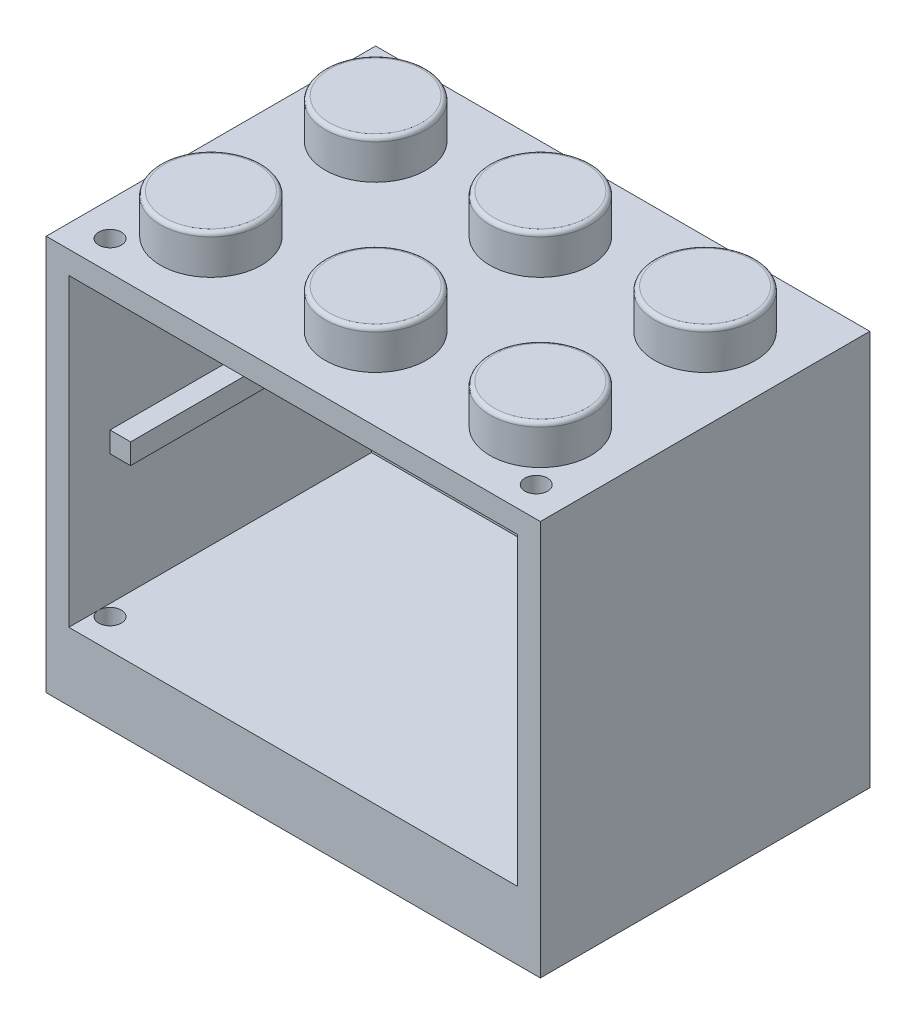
ISO-10303-21;
HEADER;
FILE_DESCRIPTION(('STEP AP214'),'2;1');
FILE_NAME('part.step','',(''),(''),'','','');
FILE_SCHEMA(('AUTOMOTIVE_DESIGN { 1 0 10303 214 1 1 1 1 }'));
ENDSEC;
DATA;
#1=APPLICATION_CONTEXT('core data for automotive mechanical design processes');
#2=APPLICATION_PROTOCOL_DEFINITION('international standard','automotive_design',2000,#1);
#3=PRODUCT_CONTEXT('',#1,'mechanical');
#4=PRODUCT('Part','Part','',(#3));
#5=PRODUCT_RELATED_PRODUCT_CATEGORY('part','',(#4));
#6=PRODUCT_DEFINITION_FORMATION('','',#4);
#7=PRODUCT_DEFINITION_CONTEXT('part definition',#1,'design');
#8=PRODUCT_DEFINITION('design','',#6,#7);
#9=PRODUCT_DEFINITION_SHAPE('','',#8);
#10=(LENGTH_UNIT() NAMED_UNIT(*) SI_UNIT(.MILLI.,.METRE.));
#11=(NAMED_UNIT(*) PLANE_ANGLE_UNIT() SI_UNIT($,.RADIAN.));
#12=(NAMED_UNIT(*) SI_UNIT($,.STERADIAN.) SOLID_ANGLE_UNIT());
#13=UNCERTAINTY_MEASURE_WITH_UNIT(LENGTH_MEASURE(1.E-05),#10,'distance_accuracy_value','');
#14=(GEOMETRIC_REPRESENTATION_CONTEXT(3) GLOBAL_UNCERTAINTY_ASSIGNED_CONTEXT((#13)) GLOBAL_UNIT_ASSIGNED_CONTEXT((#10,
#11,#12)) REPRESENTATION_CONTEXT('',''));
#15=CARTESIAN_POINT('',(0.,0.,0.));
#16=DIRECTION('',(0.,0.,1.));
#17=DIRECTION('',(1.,0.,0.));
#18=AXIS2_PLACEMENT_3D('',#15,#16,#17);
#19=CARTESIAN_POINT('',(1.09999999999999,3.3,1.3));
#20=DIRECTION('',(0.,0.,1.));
#21=DIRECTION('',(1.,0.,0.));
#22=AXIS2_PLACEMENT_3D('',#19,#20,#21);
#23=PLANE('',#22);
#24=DIRECTION('',(0.,-1.,0.));
#25=VECTOR('',#24,1.);
#26=CARTESIAN_POINT('',(21.9,10.6,1.3));
#27=LINE('',#26,#25);
#28=CARTESIAN_POINT('',(21.9,10.6,1.3));
#29=VERTEX_POINT('',#28);
#30=CARTESIAN_POINT('',(21.9,9.6,1.3));
#31=VERTEX_POINT('',#30);
#32=EDGE_CURVE('E269',#29,#31,#27,.T.);
#33=ORIENTED_EDGE('',*,*,#32,.F.);
#34=DIRECTION('',(-1.,0.,0.));
#35=VECTOR('',#34,1.);
#36=CARTESIAN_POINT('',(22.9,10.6,1.3));
#37=LINE('',#36,#35);
#38=CARTESIAN_POINT('',(22.9,10.6,1.3));
#39=VERTEX_POINT('',#38);
#40=EDGE_CURVE('E916',#39,#29,#37,.T.);
#41=ORIENTED_EDGE('',*,*,#40,.F.);
#42=DIRECTION('',(0.,1.,0.));
#43=VECTOR('',#42,1.);
#44=CARTESIAN_POINT('',(22.9,18.1,1.3));
#45=LINE('',#44,#43);
#46=CARTESIAN_POINT('',(22.9,17.1,1.3));
#47=VERTEX_POINT('',#46);
#48=EDGE_CURVE('E247',#39,#47,#45,.T.);
#49=ORIENTED_EDGE('',*,*,#48,.T.);
#50=DIRECTION('',(1.,0.,0.));
#51=VECTOR('',#50,1.);
#52=CARTESIAN_POINT('',(22.9,17.1,1.3));
#53=LINE('',#52,#51);
#54=CARTESIAN_POINT('',(22.4,17.1,1.3));
#55=VERTEX_POINT('',#54);
#56=EDGE_CURVE('E308',#55,#47,#53,.T.);
#57=ORIENTED_EDGE('',*,*,#56,.F.);
#58=DIRECTION('',(0.,-1.,0.));
#59=VECTOR('',#58,1.);
#60=CARTESIAN_POINT('',(22.4,18.1,1.3));
#61=LINE('',#60,#59);
#62=CARTESIAN_POINT('',(22.4,18.1,1.3));
#63=VERTEX_POINT('',#62);
#64=EDGE_CURVE('E305',#63,#55,#61,.T.);
#65=ORIENTED_EDGE('',*,*,#64,.F.);
#66=DIRECTION('',(-1.,0.,0.));
#67=VECTOR('',#66,1.);
#68=CARTESIAN_POINT('',(1.09999999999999,18.1,1.3));
#69=LINE('',#68,#67);
#70=CARTESIAN_POINT('',(1.6,18.1,1.3));
#71=VERTEX_POINT('',#70);
#72=EDGE_CURVE('E402',#63,#71,#69,.T.);
#73=ORIENTED_EDGE('',*,*,#72,.T.);
#74=DIRECTION('',(0.,1.,0.));
#75=VECTOR('',#74,1.);
#76=CARTESIAN_POINT('',(1.6,18.1,1.3));
#77=LINE('',#76,#75);
#78=CARTESIAN_POINT('',(1.59999999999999,17.1,1.3));
#79=VERTEX_POINT('',#78);
#80=EDGE_CURVE('E328',#79,#71,#77,.T.);
#81=ORIENTED_EDGE('',*,*,#80,.F.);
#82=DIRECTION('',(1.,0.,0.));
#83=VECTOR('',#82,1.);
#84=CARTESIAN_POINT('',(1.09999999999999,17.1,1.3));
#85=LINE('',#84,#83);
#86=CARTESIAN_POINT('',(1.09999999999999,17.1,1.3));
#87=VERTEX_POINT('',#86);
#88=EDGE_CURVE('E325',#87,#79,#85,.T.);
#89=ORIENTED_EDGE('',*,*,#88,.F.);
#90=DIRECTION('',(0.,-1.,0.));
#91=VECTOR('',#90,1.);
#92=CARTESIAN_POINT('',(1.09999999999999,18.1,1.3));
#93=LINE('',#92,#91);
#94=CARTESIAN_POINT('',(1.09999999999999,10.6,1.3));
#95=VERTEX_POINT('',#94);
#96=EDGE_CURVE('E393',#87,#95,#93,.T.);
#97=ORIENTED_EDGE('',*,*,#96,.T.);
#98=DIRECTION('',(-1.,0.,0.));
#99=VECTOR('',#98,1.);
#100=CARTESIAN_POINT('',(1.09999999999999,10.6,1.3));
#101=LINE('',#100,#99);
#102=CARTESIAN_POINT('',(2.1,10.6,1.3));
#103=VERTEX_POINT('',#102);
#104=EDGE_CURVE('E282',#103,#95,#101,.T.);
#105=ORIENTED_EDGE('',*,*,#104,.F.);
#106=DIRECTION('',(0.,1.,0.));
#107=VECTOR('',#106,1.);
#108=CARTESIAN_POINT('',(2.1,10.6,1.3));
#109=LINE('',#108,#107);
#110=CARTESIAN_POINT('',(2.1,9.6,1.3));
#111=VERTEX_POINT('',#110);
#112=EDGE_CURVE('E280',#111,#103,#109,.T.);
#113=ORIENTED_EDGE('',*,*,#112,.F.);
#114=DIRECTION('',(1.,0.,0.));
#115=VECTOR('',#114,1.);
#116=CARTESIAN_POINT('',(1.09999999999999,9.6,1.3));
#117=LINE('',#116,#115);
#118=CARTESIAN_POINT('',(1.09999999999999,9.6,1.3));
#119=VERTEX_POINT('',#118);
#120=EDGE_CURVE('E250',#119,#111,#117,.T.);
#121=ORIENTED_EDGE('',*,*,#120,.F.);
#122=CARTESIAN_POINT('',(1.09999999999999,3.3,1.3));
#123=VERTEX_POINT('',#122);
#124=EDGE_CURVE('E392',#119,#123,#93,.T.);
#125=ORIENTED_EDGE('',*,*,#124,.T.);
#126=DIRECTION('',(1.,0.,0.));
#127=VECTOR('',#126,1.);
#128=CARTESIAN_POINT('',(1.09999999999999,3.3,1.3));
#129=LINE('',#128,#127);
#130=CARTESIAN_POINT('',(22.9,3.3,1.3));
#131=VERTEX_POINT('',#130);
#132=EDGE_CURVE('E396',#123,#131,#129,.T.);
#133=ORIENTED_EDGE('',*,*,#132,.T.);
#134=CARTESIAN_POINT('',(22.9,9.6,1.3));
#135=VERTEX_POINT('',#134);
#136=EDGE_CURVE('E399',#131,#135,#45,.T.);
#137=ORIENTED_EDGE('',*,*,#136,.T.);
#138=DIRECTION('',(1.,0.,0.));
#139=VECTOR('',#138,1.);
#140=CARTESIAN_POINT('',(22.9,9.6,1.3));
#141=LINE('',#140,#139);
#142=EDGE_CURVE('E266',#31,#135,#141,.T.);
#143=ORIENTED_EDGE('',*,*,#142,.F.);
#144=EDGE_LOOP('',(#33,#41,#49,#57,#65,#73,#81,#89,#97,#105,#113,#121,#125,#133,#137,#143));
#145=FACE_BOUND('',#144,.T.);
#146=ADVANCED_FACE('F26',(#145),#23,.T.);
#147=CARTESIAN_POINT('',(22.9,18.1,1.3));
#148=DIRECTION('',(1.,0.,0.));
#149=DIRECTION('',(0.,1.,0.));
#150=AXIS2_PLACEMENT_3D('',#147,#148,#149);
#151=PLANE('',#150);
#152=DIRECTION('',(0.,0.,-1.));
#153=VECTOR('',#152,1.);
#154=CARTESIAN_POINT('',(22.9,10.6,14.));
#155=LINE('',#154,#153);
#156=CARTESIAN_POINT('',(22.9,10.6,14.));
#157=VERTEX_POINT('',#156);
#158=EDGE_CURVE('E240',#157,#39,#155,.T.);
#159=ORIENTED_EDGE('',*,*,#158,.F.);
#160=DIRECTION('',(0.,1.,0.));
#161=VECTOR('',#160,1.);
#162=CARTESIAN_POINT('',(22.9,10.6,14.));
#163=LINE('',#162,#161);
#164=CARTESIAN_POINT('',(22.9,9.6,14.));
#165=VERTEX_POINT('',#164);
#166=EDGE_CURVE('E244',#165,#157,#163,.T.);
#167=ORIENTED_EDGE('',*,*,#166,.F.);
#168=DIRECTION('',(0.,0.,-1.));
#169=VECTOR('',#168,1.);
#170=CARTESIAN_POINT('',(22.9,9.6,14.));
#171=LINE('',#170,#169);
#172=EDGE_CURVE('E274',#165,#135,#171,.T.);
#173=ORIENTED_EDGE('',*,*,#172,.T.);
#174=ORIENTED_EDGE('',*,*,#136,.F.);
#175=DIRECTION('',(0.,0.,1.));
#176=VECTOR('',#175,1.);
#177=CARTESIAN_POINT('',(22.9,3.3,1.3));
#178=LINE('',#177,#176);
#179=CARTESIAN_POINT('',(22.9,3.3,14.55));
#180=VERTEX_POINT('',#179);
#181=EDGE_CURVE('E413',#131,#180,#178,.T.);
#182=ORIENTED_EDGE('',*,*,#181,.T.);
#183=CARTESIAN_POINT('',(22.9,3.3,16.));
#184=VERTEX_POINT('',#183);
#185=EDGE_CURVE('E416',#180,#184,#178,.T.);
#186=ORIENTED_EDGE('',*,*,#185,.T.);
#187=DIRECTION('',(0.,1.,0.));
#188=VECTOR('',#187,1.);
#189=CARTESIAN_POINT('',(22.9,18.1,16.));
#190=LINE('',#189,#188);
#191=CARTESIAN_POINT('',(22.9,18.1,16.));
#192=VERTEX_POINT('',#191);
#193=EDGE_CURVE('E386',#184,#192,#190,.T.);
#194=ORIENTED_EDGE('',*,*,#193,.T.);
#195=DIRECTION('',(0.,0.,1.));
#196=VECTOR('',#195,1.);
#197=CARTESIAN_POINT('',(22.9,18.1,1.3));
#198=LINE('',#197,#196);
#199=CARTESIAN_POINT('',(22.9,18.1,14.55));
#200=VERTEX_POINT('',#199);
#201=EDGE_CURVE('E412',#200,#192,#198,.T.);
#202=ORIENTED_EDGE('',*,*,#201,.F.);
#203=CARTESIAN_POINT('',(22.9,18.1,14.));
#204=VERTEX_POINT('',#203);
#205=EDGE_CURVE('E410',#204,#200,#198,.T.);
#206=ORIENTED_EDGE('',*,*,#205,.F.);
#207=DIRECTION('',(0.,1.,0.));
#208=VECTOR('',#207,1.);
#209=CARTESIAN_POINT('',(22.9,18.1,14.));
#210=LINE('',#209,#208);
#211=CARTESIAN_POINT('',(22.9,17.1,14.));
#212=VERTEX_POINT('',#211);
#213=EDGE_CURVE('E311',#212,#204,#210,.T.);
#214=ORIENTED_EDGE('',*,*,#213,.F.);
#215=DIRECTION('',(0.,0.,-1.));
#216=VECTOR('',#215,1.);
#217=CARTESIAN_POINT('',(22.9,17.1,14.));
#218=LINE('',#217,#216);
#219=EDGE_CURVE('E319',#212,#47,#218,.T.);
#220=ORIENTED_EDGE('',*,*,#219,.T.);
#221=ORIENTED_EDGE('',*,*,#48,.F.);
#222=EDGE_LOOP('',(#159,#167,#173,#174,#182,#186,#194,#202,#206,#214,#220,#221));
#223=FACE_BOUND('',#222,.T.);
#224=ADVANCED_FACE('F242',(#223),#151,.F.);
#225=CARTESIAN_POINT('',(1.09999999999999,18.1,1.3));
#226=DIRECTION('',(-1.,0.,0.));
#227=DIRECTION('',(0.,-1.,0.));
#228=AXIS2_PLACEMENT_3D('',#225,#226,#227);
#229=PLANE('',#228);
#230=DIRECTION('',(0.,0.,-1.));
#231=VECTOR('',#230,1.);
#232=CARTESIAN_POINT('',(1.09999999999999,9.6,14.));
#233=LINE('',#232,#231);
#234=CARTESIAN_POINT('',(1.09999999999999,9.6,14.));
#235=VERTEX_POINT('',#234);
#236=EDGE_CURVE('E303',#235,#119,#233,.T.);
#237=ORIENTED_EDGE('',*,*,#236,.F.);
#238=DIRECTION('',(0.,-1.,0.));
#239=VECTOR('',#238,1.);
#240=CARTESIAN_POINT('',(1.09999999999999,10.6,14.));
#241=LINE('',#240,#239);
#242=CARTESIAN_POINT('',(1.09999999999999,10.6,14.));
#243=VERTEX_POINT('',#242);
#244=EDGE_CURVE('E284',#243,#235,#241,.T.);
#245=ORIENTED_EDGE('',*,*,#244,.F.);
#246=DIRECTION('',(0.,0.,-1.));
#247=VECTOR('',#246,1.);
#248=CARTESIAN_POINT('',(1.09999999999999,10.6,14.));
#249=LINE('',#248,#247);
#250=EDGE_CURVE('E294',#243,#95,#249,.T.);
#251=ORIENTED_EDGE('',*,*,#250,.T.);
#252=ORIENTED_EDGE('',*,*,#96,.F.);
#253=DIRECTION('',(0.,0.,-1.));
#254=VECTOR('',#253,1.);
#255=CARTESIAN_POINT('',(1.09999999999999,17.1,14.));
#256=LINE('',#255,#254);
#257=CARTESIAN_POINT('',(1.09999999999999,17.1,14.));
#258=VERTEX_POINT('',#257);
#259=EDGE_CURVE('E343',#258,#87,#256,.T.);
#260=ORIENTED_EDGE('',*,*,#259,.F.);
#261=DIRECTION('',(0.,-1.,0.));
#262=VECTOR('',#261,1.);
#263=CARTESIAN_POINT('',(1.09999999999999,18.1,14.));
#264=LINE('',#263,#262);
#265=CARTESIAN_POINT('',(1.09999999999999,18.1,14.));
#266=VERTEX_POINT('',#265);
#267=EDGE_CURVE('E331',#266,#258,#264,.T.);
#268=ORIENTED_EDGE('',*,*,#267,.F.);
#269=DIRECTION('',(0.,0.,1.));
#270=VECTOR('',#269,1.);
#271=CARTESIAN_POINT('',(1.09999999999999,18.1,1.3));
#272=LINE('',#271,#270);
#273=CARTESIAN_POINT('',(1.09999999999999,18.1,14.55));
#274=VERTEX_POINT('',#273);
#275=EDGE_CURVE('E406',#266,#274,#272,.T.);
#276=ORIENTED_EDGE('',*,*,#275,.T.);
#277=CARTESIAN_POINT('',(1.09999999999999,18.1,16.));
#278=VERTEX_POINT('',#277);
#279=EDGE_CURVE('E409',#274,#278,#272,.T.);
#280=ORIENTED_EDGE('',*,*,#279,.T.);
#281=DIRECTION('',(0.,-1.,0.));
#282=VECTOR('',#281,1.);
#283=CARTESIAN_POINT('',(1.09999999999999,18.1,16.));
#284=LINE('',#283,#282);
#285=CARTESIAN_POINT('',(1.09999999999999,3.3,16.));
#286=VERTEX_POINT('',#285);
#287=EDGE_CURVE('E380',#278,#286,#284,.T.);
#288=ORIENTED_EDGE('',*,*,#287,.T.);
#289=DIRECTION('',(0.,0.,1.));
#290=VECTOR('',#289,1.);
#291=CARTESIAN_POINT('',(1.09999999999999,3.3,1.3));
#292=LINE('',#291,#290);
#293=CARTESIAN_POINT('',(1.09999999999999,3.3,14.55));
#294=VERTEX_POINT('',#293);
#295=EDGE_CURVE('E405',#294,#286,#292,.T.);
#296=ORIENTED_EDGE('',*,*,#295,.F.);
#297=EDGE_CURVE('E417',#123,#294,#292,.T.);
#298=ORIENTED_EDGE('',*,*,#297,.F.);
#299=ORIENTED_EDGE('',*,*,#124,.F.);
#300=EDGE_LOOP('',(#237,#245,#251,#252,#260,#268,#276,#280,#288,#296,#298,#299));
#301=FACE_BOUND('',#300,.T.);
#302=ADVANCED_FACE('F602',(#301),#229,.F.);
#303=CARTESIAN_POINT('',(1.09999999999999,18.1,1.3));
#304=DIRECTION('',(0.,1.,0.));
#305=DIRECTION('',(0.,0.,1.));
#306=AXIS2_PLACEMENT_3D('',#303,#304,#305);
#307=PLANE('',#306);
#308=DIRECTION('',(0.,0.,-1.));
#309=VECTOR('',#308,1.);
#310=CARTESIAN_POINT('',(22.4,18.1,14.));
#311=LINE('',#310,#309);
#312=CARTESIAN_POINT('',(22.4,18.1,13.9));
#313=VERTEX_POINT('',#312);
#314=EDGE_CURVE('E323',#313,#63,#311,.T.);
#315=ORIENTED_EDGE('',*,*,#314,.F.);
#316=CARTESIAN_POINT('',(22.5,18.1,13.9));
#317=DIRECTION('',(0.,1.,0.));
#318=DIRECTION('',(0.,0.,1.));
#319=AXIS2_PLACEMENT_3D('',#316,#317,#318);
#320=CIRCLE('',#319,0.1);
#321=CARTESIAN_POINT('',(22.5,18.1,14.));
#322=VERTEX_POINT('',#321);
#323=EDGE_CURVE('E570',#313,#322,#320,.T.);
#324=ORIENTED_EDGE('',*,*,#323,.T.);
#325=DIRECTION('',(-1.,0.,0.));
#326=VECTOR('',#325,1.);
#327=CARTESIAN_POINT('',(22.9,18.1,14.));
#328=LINE('',#327,#326);
#329=EDGE_CURVE('E314',#204,#322,#328,.T.);
#330=ORIENTED_EDGE('',*,*,#329,.F.);
#331=ORIENTED_EDGE('',*,*,#205,.T.);
#332=CARTESIAN_POINT('',(22.35,18.1,14.55));
#333=DIRECTION('',(0.,1.,0.));
#334=DIRECTION('',(0.,0.,1.));
#335=AXIS2_PLACEMENT_3D('',#332,#333,#334);
#336=CIRCLE('',#335,0.55);
#337=EDGE_CURVE('E348',#200,#200,#336,.T.);
#338=ORIENTED_EDGE('',*,*,#337,.T.);
#339=ORIENTED_EDGE('',*,*,#201,.T.);
#340=DIRECTION('',(-1.,0.,0.));
#341=VECTOR('',#340,1.);
#342=CARTESIAN_POINT('',(1.09999999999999,18.1,16.));
#343=LINE('',#342,#341);
#344=EDGE_CURVE('E389',#192,#278,#343,.T.);
#345=ORIENTED_EDGE('',*,*,#344,.T.);
#346=ORIENTED_EDGE('',*,*,#279,.F.);
#347=CARTESIAN_POINT('',(1.64999999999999,18.1,14.55));
#348=DIRECTION('',(0.,1.,0.));
#349=DIRECTION('',(0.,0.,1.));
#350=AXIS2_PLACEMENT_3D('',#347,#348,#349);
#351=CIRCLE('',#350,0.55);
#352=EDGE_CURVE('E365',#274,#274,#351,.T.);
#353=ORIENTED_EDGE('',*,*,#352,.T.);
#354=ORIENTED_EDGE('',*,*,#275,.F.);
#355=DIRECTION('',(-1.,0.,0.));
#356=VECTOR('',#355,1.);
#357=CARTESIAN_POINT('',(1.09999999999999,18.1,14.));
#358=LINE('',#357,#356);
#359=CARTESIAN_POINT('',(1.5,18.1,14.));
#360=VERTEX_POINT('',#359);
#361=EDGE_CURVE('E337',#360,#266,#358,.T.);
#362=ORIENTED_EDGE('',*,*,#361,.F.);
#363=CARTESIAN_POINT('',(1.5,18.1,13.9));
#364=DIRECTION('',(0.,1.,0.));
#365=DIRECTION('',(0.,0.,1.));
#366=AXIS2_PLACEMENT_3D('',#363,#364,#365);
#367=CIRCLE('',#366,0.1);
#368=CARTESIAN_POINT('',(1.6,18.1,13.9));
#369=VERTEX_POINT('',#368);
#370=EDGE_CURVE('E11',#360,#369,#367,.T.);
#371=ORIENTED_EDGE('',*,*,#370,.T.);
#372=DIRECTION('',(0.,0.,-1.));
#373=VECTOR('',#372,1.);
#374=CARTESIAN_POINT('',(1.6,18.1,14.));
#375=LINE('',#374,#373);
#376=EDGE_CURVE('E339',#369,#71,#375,.T.);
#377=ORIENTED_EDGE('',*,*,#376,.T.);
#378=ORIENTED_EDGE('',*,*,#72,.F.);
#379=EDGE_LOOP('',(#315,#324,#330,#331,#338,#339,#345,#346,#353,#354,#362,#371,#377,#378));
#380=FACE_BOUND('',#379,.T.);
#381=ADVANCED_FACE('F609',(#380),#307,.F.);
#382=CARTESIAN_POINT('',(0.,19.2,16.));
#383=DIRECTION('',(0.,-1.,0.));
#384=DIRECTION('',(0.,0.,-1.));
#385=AXIS2_PLACEMENT_3D('',#382,#383,#384);
#386=PLANE('',#385);
#387=CARTESIAN_POINT('',(22.35,19.2,14.55));
#388=DIRECTION('',(0.,-1.,0.));
#389=DIRECTION('',(0.,0.,-1.));
#390=AXIS2_PLACEMENT_3D('',#387,#388,#389);
#391=CIRCLE('',#390,0.55);
#392=CARTESIAN_POINT('',(22.35,19.2,14.));
#393=VERTEX_POINT('',#392);
#394=EDGE_CURVE('E359',#393,#393,#391,.T.);
#395=ORIENTED_EDGE('',*,*,#394,.T.);
#396=EDGE_LOOP('',(#395));
#397=FACE_BOUND('',#396,.T.);
#398=CARTESIAN_POINT('',(1.64999999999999,19.2,14.55));
#399=DIRECTION('',(0.,-1.,0.));
#400=DIRECTION('',(0.,0.,-1.));
#401=AXIS2_PLACEMENT_3D('',#398,#399,#400);
#402=CIRCLE('',#401,0.55);
#403=CARTESIAN_POINT('',(1.64999999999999,19.2,14.));
#404=VERTEX_POINT('',#403);
#405=EDGE_CURVE('E377',#404,#404,#402,.T.);
#406=ORIENTED_EDGE('',*,*,#405,.T.);
#407=EDGE_LOOP('',(#406));
#408=FACE_BOUND('',#407,.T.);
#409=CARTESIAN_POINT('',(12.,19.2,12.));
#410=DIRECTION('',(0.,-1.,0.));
#411=DIRECTION('',(0.,0.,-1.));
#412=AXIS2_PLACEMENT_3D('',#409,#410,#411);
#413=CIRCLE('',#412,2.45);
#414=CARTESIAN_POINT('',(12.,19.2,9.55));
#415=VERTEX_POINT('',#414);
#416=EDGE_CURVE('E510',#415,#415,#413,.F.);
#417=ORIENTED_EDGE('',*,*,#416,.F.);
#418=EDGE_LOOP('',(#417));
#419=FACE_BOUND('',#418,.T.);
#420=CARTESIAN_POINT('',(20.,19.2,4.));
#421=DIRECTION('',(0.,-1.,0.));
#422=DIRECTION('',(0.,0.,-1.));
#423=AXIS2_PLACEMENT_3D('',#420,#421,#422);
#424=CIRCLE('',#423,2.45);
#425=CARTESIAN_POINT('',(20.,19.2,1.55));
#426=VERTEX_POINT('',#425);
#427=EDGE_CURVE('E504',#426,#426,#424,.F.);
#428=ORIENTED_EDGE('',*,*,#427,.F.);
#429=EDGE_LOOP('',(#428));
#430=FACE_BOUND('',#429,.T.);
#431=CARTESIAN_POINT('',(3.99999999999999,19.2,4.));
#432=DIRECTION('',(0.,-1.,0.));
#433=DIRECTION('',(0.,0.,-1.));
#434=AXIS2_PLACEMENT_3D('',#431,#432,#433);
#435=CIRCLE('',#434,2.45);
#436=CARTESIAN_POINT('',(3.99999999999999,19.2,1.55));
#437=VERTEX_POINT('',#436);
#438=EDGE_CURVE('E498',#437,#437,#435,.F.);
#439=ORIENTED_EDGE('',*,*,#438,.F.);
#440=EDGE_LOOP('',(#439));
#441=FACE_BOUND('',#440,.T.);
#442=DIRECTION('',(-1.,0.,0.));
#443=VECTOR('',#442,1.);
#444=CARTESIAN_POINT('',(0.,19.2,0.));
#445=LINE('',#444,#443);
#446=CARTESIAN_POINT('',(24.,19.2,0.));
#447=VERTEX_POINT('',#446);
#448=CARTESIAN_POINT('',(0.,19.2,0.));
#449=VERTEX_POINT('',#448);
#450=EDGE_CURVE('E469',#447,#449,#445,.T.);
#451=ORIENTED_EDGE('',*,*,#450,.T.);
#452=DIRECTION('',(0.,0.,-1.));
#453=VECTOR('',#452,1.);
#454=CARTESIAN_POINT('',(0.,19.2,16.));
#455=LINE('',#454,#453);
#456=CARTESIAN_POINT('',(0.,19.2,16.));
#457=VERTEX_POINT('',#456);
#458=EDGE_CURVE('E480',#457,#449,#455,.T.);
#459=ORIENTED_EDGE('',*,*,#458,.F.);
#460=DIRECTION('',(-1.,0.,0.));
#461=VECTOR('',#460,1.);
#462=CARTESIAN_POINT('',(0.,19.2,16.));
#463=LINE('',#462,#461);
#464=CARTESIAN_POINT('',(24.,19.2,16.));
#465=VERTEX_POINT('',#464);
#466=EDGE_CURVE('E478',#465,#457,#463,.T.);
#467=ORIENTED_EDGE('',*,*,#466,.F.);
#468=DIRECTION('',(0.,0.,-1.));
#469=VECTOR('',#468,1.);
#470=CARTESIAN_POINT('',(24.,19.2,16.));
#471=LINE('',#470,#469);
#472=EDGE_CURVE('E483',#465,#447,#471,.T.);
#473=ORIENTED_EDGE('',*,*,#472,.T.);
#474=EDGE_LOOP('',(#451,#459,#467,#473));
#475=FACE_BOUND('',#474,.T.);
#476=CARTESIAN_POINT('',(12.,19.2,4.));
#477=DIRECTION('',(0.,-1.,0.));
#478=DIRECTION('',(0.,0.,-1.));
#479=AXIS2_PLACEMENT_3D('',#476,#477,#478);
#480=CIRCLE('',#479,2.45);
#481=CARTESIAN_POINT('',(12.,19.2,1.55));
#482=VERTEX_POINT('',#481);
#483=EDGE_CURVE('E501',#482,#482,#480,.F.);
#484=ORIENTED_EDGE('',*,*,#483,.F.);
#485=EDGE_LOOP('',(#484));
#486=FACE_BOUND('',#485,.T.);
#487=CARTESIAN_POINT('',(3.99999999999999,19.2,12.));
#488=DIRECTION('',(0.,-1.,0.));
#489=DIRECTION('',(0.,0.,-1.));
#490=AXIS2_PLACEMENT_3D('',#487,#488,#489);
#491=CIRCLE('',#490,2.45);
#492=CARTESIAN_POINT('',(3.99999999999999,19.2,9.55));
#493=VERTEX_POINT('',#492);
#494=EDGE_CURVE('E507',#493,#493,#491,.F.);
#495=ORIENTED_EDGE('',*,*,#494,.F.);
#496=EDGE_LOOP('',(#495));
#497=FACE_BOUND('',#496,.T.);
#498=CARTESIAN_POINT('',(20.,19.2,12.));
#499=DIRECTION('',(0.,-1.,0.));
#500=DIRECTION('',(0.,0.,-1.));
#501=AXIS2_PLACEMENT_3D('',#498,#499,#500);
#502=CIRCLE('',#501,2.45);
#503=CARTESIAN_POINT('',(20.,19.2,9.55));
#504=VERTEX_POINT('',#503);
#505=EDGE_CURVE('E513',#504,#504,#502,.F.);
#506=ORIENTED_EDGE('',*,*,#505,.F.);
#507=EDGE_LOOP('',(#506));
#508=FACE_BOUND('',#507,.T.);
#509=ADVANCED_FACE('F611',(#397,#408,#419,#430,#441,#475,#486,#497,#508),#386,.F.);
#510=CARTESIAN_POINT('',(1.6,2.1,1.6));
#511=DIRECTION('',(0.,-1.,0.));
#512=DIRECTION('',(0.,0.,-1.));
#513=AXIS2_PLACEMENT_3D('',#510,#511,#512);
#514=PLANE('',#513);
#515=CARTESIAN_POINT('',(22.35,2.1,14.55));
#516=DIRECTION('',(0.,-1.,0.));
#517=DIRECTION('',(0.,0.,-1.));
#518=AXIS2_PLACEMENT_3D('',#515,#516,#517);
#519=CIRCLE('',#518,0.55);
#520=CARTESIAN_POINT('',(21.8208497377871,2.1,14.4));
#521=VERTEX_POINT('',#520);
#522=CARTESIAN_POINT('',(22.4,2.1,14.0022774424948));
#523=VERTEX_POINT('',#522);
#524=EDGE_CURVE('E354',#521,#523,#519,.T.);
#525=ORIENTED_EDGE('',*,*,#524,.F.);
#526=DIRECTION('',(-1.,0.,0.));
#527=VECTOR('',#526,1.);
#528=CARTESIAN_POINT('',(1.6,2.1,14.4));
#529=LINE('',#528,#527);
#530=CARTESIAN_POINT('',(2.17915026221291,2.1,14.4));
#531=VERTEX_POINT('',#530);
#532=EDGE_CURVE('E455',#521,#531,#529,.T.);
#533=ORIENTED_EDGE('',*,*,#532,.T.);
#534=CARTESIAN_POINT('',(1.64999999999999,2.1,14.55));
#535=DIRECTION('',(0.,-1.,0.));
#536=DIRECTION('',(0.,0.,-1.));
#537=AXIS2_PLACEMENT_3D('',#534,#535,#536);
#538=CIRCLE('',#537,0.55);
#539=CARTESIAN_POINT('',(1.6,2.1,14.0022774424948));
#540=VERTEX_POINT('',#539);
#541=EDGE_CURVE('E371',#540,#531,#538,.T.);
#542=ORIENTED_EDGE('',*,*,#541,.F.);
#543=DIRECTION('',(0.,0.,-1.));
#544=VECTOR('',#543,1.);
#545=CARTESIAN_POINT('',(1.6,2.1,14.4));
#546=LINE('',#545,#544);
#547=CARTESIAN_POINT('',(1.6,2.1,1.6));
#548=VERTEX_POINT('',#547);
#549=EDGE_CURVE('E447',#540,#548,#546,.T.);
#550=ORIENTED_EDGE('',*,*,#549,.T.);
#551=DIRECTION('',(1.,0.,0.));
#552=VECTOR('',#551,1.);
#553=CARTESIAN_POINT('',(1.6,2.1,1.6));
#554=LINE('',#553,#552);
#555=CARTESIAN_POINT('',(22.4,2.1,1.6));
#556=VERTEX_POINT('',#555);
#557=EDGE_CURVE('E449',#548,#556,#554,.T.);
#558=ORIENTED_EDGE('',*,*,#557,.T.);
#559=DIRECTION('',(0.,0.,1.));
#560=VECTOR('',#559,1.);
#561=CARTESIAN_POINT('',(22.4,2.1,14.4));
#562=LINE('',#561,#560);
#563=EDGE_CURVE('E452',#556,#523,#562,.T.);
#564=ORIENTED_EDGE('',*,*,#563,.T.);
#565=EDGE_LOOP('',(#525,#533,#542,#550,#558,#564));
#566=FACE_BOUND('',#565,.T.);
#567=CARTESIAN_POINT('',(8.,2.1,8.));
#568=DIRECTION('',(0.,-1.,0.));
#569=DIRECTION('',(0.,0.,-1.));
#570=AXIS2_PLACEMENT_3D('',#567,#568,#569);
#571=CIRCLE('',#570,3.25);
#572=CARTESIAN_POINT('',(8.,2.1,4.75));
#573=VERTEX_POINT('',#572);
#574=EDGE_CURVE('E431',#573,#573,#571,.T.);
#575=ORIENTED_EDGE('',*,*,#574,.F.);
#576=EDGE_LOOP('',(#575));
#577=FACE_BOUND('',#576,.T.);
#578=CARTESIAN_POINT('',(16.,2.1,8.));
#579=DIRECTION('',(0.,-1.,0.));
#580=DIRECTION('',(0.,0.,-1.));
#581=AXIS2_PLACEMENT_3D('',#578,#579,#580);
#582=CIRCLE('',#581,3.25);
#583=CARTESIAN_POINT('',(16.,2.1,4.75));
#584=VERTEX_POINT('',#583);
#585=EDGE_CURVE('E422',#584,#584,#582,.T.);
#586=ORIENTED_EDGE('',*,*,#585,.F.);
#587=EDGE_LOOP('',(#586));
#588=FACE_BOUND('',#587,.T.);
#589=ADVANCED_FACE('F723',(#566,#577,#588),#514,.T.);
#590=CARTESIAN_POINT('',(0.,0.,16.));
#591=DIRECTION('',(1.,0.,0.));
#592=DIRECTION('',(0.,1.,0.));
#593=AXIS2_PLACEMENT_3D('',#590,#591,#592);
#594=PLANE('',#593);
#595=DIRECTION('',(0.,-1.,0.));
#596=VECTOR('',#595,1.);
#597=CARTESIAN_POINT('',(0.,0.,0.));
#598=LINE('',#597,#596);
#599=CARTESIAN_POINT('',(0.,0.,0.));
#600=VERTEX_POINT('',#599);
#601=EDGE_CURVE('E460',#449,#600,#598,.T.);
#602=ORIENTED_EDGE('',*,*,#601,.T.);
#603=DIRECTION('',(0.,0.,-1.));
#604=VECTOR('',#603,1.);
#605=CARTESIAN_POINT('',(0.,0.,16.));
#606=LINE('',#605,#604);
#607=CARTESIAN_POINT('',(0.,0.,16.));
#608=VERTEX_POINT('',#607);
#609=EDGE_CURVE('E489',#608,#600,#606,.T.);
#610=ORIENTED_EDGE('',*,*,#609,.F.);
#611=DIRECTION('',(0.,-1.,0.));
#612=VECTOR('',#611,1.);
#613=CARTESIAN_POINT('',(0.,0.,16.));
#614=LINE('',#613,#612);
#615=EDGE_CURVE('E471',#457,#608,#614,.T.);
#616=ORIENTED_EDGE('',*,*,#615,.F.);
#617=ORIENTED_EDGE('',*,*,#458,.T.);
#618=EDGE_LOOP('',(#602,#610,#616,#617));
#619=FACE_BOUND('',#618,.T.);
#620=ADVANCED_FACE('F28',(#619),#594,.F.);
#621=CARTESIAN_POINT('',(0.,0.,16.));
#622=DIRECTION('',(0.,1.,0.));
#623=DIRECTION('',(0.,0.,1.));
#624=AXIS2_PLACEMENT_3D('',#621,#622,#623);
#625=PLANE('',#624);
#626=DIRECTION('',(-1.,0.,0.));
#627=VECTOR('',#626,1.);
#628=CARTESIAN_POINT('',(1.6,0.,14.4));
#629=LINE('',#628,#627);
#630=CARTESIAN_POINT('',(21.8208497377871,0.,14.4));
#631=VERTEX_POINT('',#630);
#632=CARTESIAN_POINT('',(2.17915026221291,0.,14.4));
#633=VERTEX_POINT('',#632);
#634=EDGE_CURVE('E445',#631,#633,#629,.T.);
#635=ORIENTED_EDGE('',*,*,#634,.F.);
#636=CARTESIAN_POINT('',(22.35,0.,14.55));
#637=DIRECTION('',(0.,-1.,0.));
#638=DIRECTION('',(0.,0.,-1.));
#639=AXIS2_PLACEMENT_3D('',#636,#637,#638);
#640=CIRCLE('',#639,0.55);
#641=CARTESIAN_POINT('',(22.4,0.,14.0022774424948));
#642=VERTEX_POINT('',#641);
#643=EDGE_CURVE('E345',#642,#631,#640,.T.);
#644=ORIENTED_EDGE('',*,*,#643,.F.);
#645=DIRECTION('',(0.,0.,1.));
#646=VECTOR('',#645,1.);
#647=CARTESIAN_POINT('',(22.4,0.,14.4));
#648=LINE('',#647,#646);
#649=CARTESIAN_POINT('',(22.4,0.,1.6));
#650=VERTEX_POINT('',#649);
#651=EDGE_CURVE('E442',#650,#642,#648,.T.);
#652=ORIENTED_EDGE('',*,*,#651,.F.);
#653=DIRECTION('',(1.,0.,0.));
#654=VECTOR('',#653,1.);
#655=CARTESIAN_POINT('',(1.6,0.,1.6));
#656=LINE('',#655,#654);
#657=CARTESIAN_POINT('',(1.6,0.,1.6));
#658=VERTEX_POINT('',#657);
#659=EDGE_CURVE('E439',#658,#650,#656,.T.);
#660=ORIENTED_EDGE('',*,*,#659,.F.);
#661=DIRECTION('',(0.,0.,-1.));
#662=VECTOR('',#661,1.);
#663=CARTESIAN_POINT('',(1.6,0.,14.4));
#664=LINE('',#663,#662);
#665=CARTESIAN_POINT('',(1.6,0.,14.0022774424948));
#666=VERTEX_POINT('',#665);
#667=EDGE_CURVE('E437',#666,#658,#664,.T.);
#668=ORIENTED_EDGE('',*,*,#667,.F.);
#669=CARTESIAN_POINT('',(1.64999999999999,0.,14.55));
#670=DIRECTION('',(0.,-1.,0.));
#671=DIRECTION('',(0.,0.,-1.));
#672=AXIS2_PLACEMENT_3D('',#669,#670,#671);
#673=CIRCLE('',#672,0.55);
#674=EDGE_CURVE('E362',#633,#666,#673,.T.);
#675=ORIENTED_EDGE('',*,*,#674,.F.);
#676=EDGE_LOOP('',(#635,#644,#652,#660,#668,#675));
#677=FACE_BOUND('',#676,.T.);
#678=DIRECTION('',(1.,0.,0.));
#679=VECTOR('',#678,1.);
#680=CARTESIAN_POINT('',(0.,0.,0.));
#681=LINE('',#680,#679);
#682=CARTESIAN_POINT('',(24.,0.,0.));
#683=VERTEX_POINT('',#682);
#684=EDGE_CURVE('E465',#600,#683,#681,.T.);
#685=ORIENTED_EDGE('',*,*,#684,.T.);
#686=DIRECTION('',(0.,0.,-1.));
#687=VECTOR('',#686,1.);
#688=CARTESIAN_POINT('',(24.,0.,16.));
#689=LINE('',#688,#687);
#690=CARTESIAN_POINT('',(24.,0.,16.));
#691=VERTEX_POINT('',#690);
#692=EDGE_CURVE('E486',#691,#683,#689,.T.);
#693=ORIENTED_EDGE('',*,*,#692,.F.);
#694=DIRECTION('',(1.,0.,0.));
#695=VECTOR('',#694,1.);
#696=CARTESIAN_POINT('',(0.,0.,16.));
#697=LINE('',#696,#695);
#698=EDGE_CURVE('E474',#608,#691,#697,.T.);
#699=ORIENTED_EDGE('',*,*,#698,.F.);
#700=ORIENTED_EDGE('',*,*,#609,.T.);
#701=EDGE_LOOP('',(#685,#693,#699,#700));
#702=FACE_BOUND('',#701,.T.);
#703=ADVANCED_FACE('F752',(#677,#702),#625,.F.);
#704=CARTESIAN_POINT('',(24.,0.,16.));
#705=DIRECTION('',(-1.,0.,0.));
#706=DIRECTION('',(0.,0.,1.));
#707=AXIS2_PLACEMENT_3D('',#704,#705,#706);
#708=PLANE('',#707);
#709=DIRECTION('',(0.,1.,0.));
#710=VECTOR('',#709,1.);
#711=CARTESIAN_POINT('',(24.,0.,0.));
#712=LINE('',#711,#710);
#713=EDGE_CURVE('E467',#683,#447,#712,.T.);
#714=ORIENTED_EDGE('',*,*,#713,.T.);
#715=ORIENTED_EDGE('',*,*,#472,.F.);
#716=DIRECTION('',(0.,1.,0.));
#717=VECTOR('',#716,1.);
#718=CARTESIAN_POINT('',(24.,0.,16.));
#719=LINE('',#718,#717);
#720=EDGE_CURVE('E476',#691,#465,#719,.T.);
#721=ORIENTED_EDGE('',*,*,#720,.F.);
#722=ORIENTED_EDGE('',*,*,#692,.T.);
#723=EDGE_LOOP('',(#714,#715,#721,#722));
#724=FACE_BOUND('',#723,.T.);
#725=ADVANCED_FACE('F746',(#724),#708,.F.);
#726=CARTESIAN_POINT('',(0.,19.2,16.));
#727=DIRECTION('',(0.,0.,-1.));
#728=DIRECTION('',(-1.,0.,0.));
#729=AXIS2_PLACEMENT_3D('',#726,#727,#728);
#730=PLANE('',#729);
#731=DIRECTION('',(1.,0.,0.));
#732=VECTOR('',#731,1.);
#733=CARTESIAN_POINT('',(1.09999999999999,3.3,16.));
#734=LINE('',#733,#732);
#735=EDGE_CURVE('E383',#286,#184,#734,.T.);
#736=ORIENTED_EDGE('',*,*,#735,.F.);
#737=ORIENTED_EDGE('',*,*,#287,.F.);
#738=ORIENTED_EDGE('',*,*,#344,.F.);
#739=ORIENTED_EDGE('',*,*,#193,.F.);
#740=EDGE_LOOP('',(#736,#737,#738,#739));
#741=FACE_BOUND('',#740,.T.);
#742=ORIENTED_EDGE('',*,*,#615,.T.);
#743=ORIENTED_EDGE('',*,*,#698,.T.);
#744=ORIENTED_EDGE('',*,*,#720,.T.);
#745=ORIENTED_EDGE('',*,*,#466,.T.);
#746=EDGE_LOOP('',(#742,#743,#744,#745));
#747=FACE_BOUND('',#746,.T.);
#748=ADVANCED_FACE('F742',(#741,#747),#730,.F.);
#749=CARTESIAN_POINT('',(0.,19.2,0.));
#750=DIRECTION('',(0.,0.,-1.));
#751=DIRECTION('',(-1.,0.,0.));
#752=AXIS2_PLACEMENT_3D('',#749,#750,#751);
#753=PLANE('',#752);
#754=ORIENTED_EDGE('',*,*,#601,.F.);
#755=ORIENTED_EDGE('',*,*,#450,.F.);
#756=ORIENTED_EDGE('',*,*,#713,.F.);
#757=ORIENTED_EDGE('',*,*,#684,.F.);
#758=EDGE_LOOP('',(#754,#755,#756,#757));
#759=FACE_BOUND('',#758,.T.);
#760=ADVANCED_FACE('F738',(#759),#753,.T.);
#761=CARTESIAN_POINT('',(1.6,2.1,14.4));
#762=DIRECTION('',(-1.,0.,0.));
#763=DIRECTION('',(0.,0.,1.));
#764=AXIS2_PLACEMENT_3D('',#761,#762,#763);
#765=PLANE('',#764);
#766=ORIENTED_EDGE('',*,*,#549,.F.);
#767=DIRECTION('',(0.,-1.,0.));
#768=VECTOR('',#767,1.);
#769=CARTESIAN_POINT('',(1.6,21.1,14.0022774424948));
#770=LINE('',#769,#768);
#771=EDGE_CURVE('E374',#540,#666,#770,.T.);
#772=ORIENTED_EDGE('',*,*,#771,.T.);
#773=ORIENTED_EDGE('',*,*,#667,.T.);
#774=DIRECTION('',(0.,-1.,0.));
#775=VECTOR('',#774,1.);
#776=CARTESIAN_POINT('',(1.6,2.1,1.6));
#777=LINE('',#776,#775);
#778=EDGE_CURVE('E457',#548,#658,#777,.T.);
#779=ORIENTED_EDGE('',*,*,#778,.F.);
#780=EDGE_LOOP('',(#766,#772,#773,#779));
#781=FACE_BOUND('',#780,.T.);
#782=ADVANCED_FACE('F728',(#781),#765,.F.);
#783=CARTESIAN_POINT('',(1.6,2.1,14.4));
#784=DIRECTION('',(0.,0.,1.));
#785=DIRECTION('',(1.,0.,0.));
#786=AXIS2_PLACEMENT_3D('',#783,#784,#785);
#787=PLANE('',#786);
#788=ORIENTED_EDGE('',*,*,#532,.F.);
#789=DIRECTION('',(0.,-1.,0.));
#790=VECTOR('',#789,1.);
#791=CARTESIAN_POINT('',(21.8208497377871,21.1,14.4));
#792=LINE('',#791,#790);
#793=EDGE_CURVE('E356',#521,#631,#792,.T.);
#794=ORIENTED_EDGE('',*,*,#793,.T.);
#795=ORIENTED_EDGE('',*,*,#634,.T.);
#796=DIRECTION('',(0.,-1.,0.));
#797=VECTOR('',#796,1.);
#798=CARTESIAN_POINT('',(2.17915026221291,21.1,14.4));
#799=LINE('',#798,#797);
#800=EDGE_CURVE('E368',#633,#531,#799,.F.);
#801=ORIENTED_EDGE('',*,*,#800,.T.);
#802=EDGE_LOOP('',(#788,#794,#795,#801));
#803=FACE_BOUND('',#802,.T.);
#804=ADVANCED_FACE('F724',(#803),#787,.F.);
#805=CARTESIAN_POINT('',(22.4,2.1,14.4));
#806=DIRECTION('',(1.,0.,0.));
#807=DIRECTION('',(0.,0.,-1.));
#808=AXIS2_PLACEMENT_3D('',#805,#806,#807);
#809=PLANE('',#808);
#810=ORIENTED_EDGE('',*,*,#651,.T.);
#811=DIRECTION('',(0.,-1.,0.));
#812=VECTOR('',#811,1.);
#813=CARTESIAN_POINT('',(22.4,21.1,14.0022774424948));
#814=LINE('',#813,#812);
#815=EDGE_CURVE('E351',#642,#523,#814,.F.);
#816=ORIENTED_EDGE('',*,*,#815,.T.);
#817=ORIENTED_EDGE('',*,*,#563,.F.);
#818=DIRECTION('',(0.,-1.,0.));
#819=VECTOR('',#818,1.);
#820=CARTESIAN_POINT('',(22.4,2.1,1.6));
#821=LINE('',#820,#819);
#822=EDGE_CURVE('E458',#556,#650,#821,.T.);
#823=ORIENTED_EDGE('',*,*,#822,.T.);
#824=EDGE_LOOP('',(#810,#816,#817,#823));
#825=FACE_BOUND('',#824,.T.);
#826=ADVANCED_FACE('F727',(#825),#809,.F.);
#827=CARTESIAN_POINT('',(1.6,2.1,1.6));
#828=DIRECTION('',(0.,0.,-1.));
#829=DIRECTION('',(-1.,0.,0.));
#830=AXIS2_PLACEMENT_3D('',#827,#828,#829);
#831=PLANE('',#830);
#832=ORIENTED_EDGE('',*,*,#659,.T.);
#833=ORIENTED_EDGE('',*,*,#822,.F.);
#834=ORIENTED_EDGE('',*,*,#557,.F.);
#835=ORIENTED_EDGE('',*,*,#778,.T.);
#836=EDGE_LOOP('',(#832,#833,#834,#835));
#837=FACE_BOUND('',#836,.T.);
#838=ADVANCED_FACE('F715',(#837),#831,.F.);
#839=CARTESIAN_POINT('',(8.,0.1,8.));
#840=DIRECTION('',(0.,-1.,0.));
#841=DIRECTION('',(0.,0.,-1.));
#842=AXIS2_PLACEMENT_3D('',#839,#840,#841);
#843=PLANE('',#842);
#844=CARTESIAN_POINT('',(8.,0.1,8.));
#845=DIRECTION('',(0.,-1.,0.));
#846=DIRECTION('',(0.,0.,-1.));
#847=AXIS2_PLACEMENT_3D('',#844,#845,#846);
#848=CIRCLE('',#847,3.25);
#849=CARTESIAN_POINT('',(8.,0.1,4.75));
#850=VERTEX_POINT('',#849);
#851=EDGE_CURVE('E434',#850,#850,#848,.T.);
#852=ORIENTED_EDGE('',*,*,#851,.T.);
#853=EDGE_LOOP('',(#852));
#854=FACE_BOUND('',#853,.T.);
#855=CARTESIAN_POINT('',(8.,0.1,8.));
#856=DIRECTION('',(0.,-1.,0.));
#857=DIRECTION('',(0.,0.,-1.));
#858=AXIS2_PLACEMENT_3D('',#855,#856,#857);
#859=CIRCLE('',#858,2.45);
#860=CARTESIAN_POINT('',(8.,0.1,5.55));
#861=VERTEX_POINT('',#860);
#862=EDGE_CURVE('E428',#861,#861,#859,.T.);
#863=ORIENTED_EDGE('',*,*,#862,.F.);
#864=EDGE_LOOP('',(#863));
#865=FACE_BOUND('',#864,.T.);
#866=ADVANCED_FACE('F712',(#854,#865),#843,.T.);
#867=CARTESIAN_POINT('',(8.,0.1,8.));
#868=DIRECTION('',(0.,1.,0.));
#869=DIRECTION('',(0.,0.,1.));
#870=AXIS2_PLACEMENT_3D('',#867,#868,#869);
#871=CYLINDRICAL_SURFACE('',#870,3.25);
#872=ORIENTED_EDGE('',*,*,#851,.F.);
#873=EDGE_LOOP('',(#872));
#874=FACE_BOUND('',#873,.T.);
#875=ORIENTED_EDGE('',*,*,#574,.T.);
#876=EDGE_LOOP('',(#875));
#877=FACE_BOUND('',#876,.T.);
#878=ADVANCED_FACE('F710',(#874,#877),#871,.T.);
#879=CARTESIAN_POINT('',(8.,0.1,8.));
#880=DIRECTION('',(0.,1.,0.));
#881=DIRECTION('',(0.,0.,1.));
#882=AXIS2_PLACEMENT_3D('',#879,#880,#881);
#883=CYLINDRICAL_SURFACE('',#882,2.45);
#884=ORIENTED_EDGE('',*,*,#862,.T.);
#885=EDGE_LOOP('',(#884));
#886=FACE_BOUND('',#885,.T.);
#887=CARTESIAN_POINT('',(8.,2.1,8.));
#888=DIRECTION('',(0.,-1.,0.));
#889=DIRECTION('',(0.,0.,-1.));
#890=AXIS2_PLACEMENT_3D('',#887,#888,#889);
#891=CIRCLE('',#890,2.45);
#892=CARTESIAN_POINT('',(8.,2.1,5.55));
#893=VERTEX_POINT('',#892);
#894=EDGE_CURVE('E492',#893,#893,#891,.F.);
#895=ORIENTED_EDGE('',*,*,#894,.T.);
#896=EDGE_LOOP('',(#895));
#897=FACE_BOUND('',#896,.T.);
#898=ADVANCED_FACE('F707',(#886,#897),#883,.F.);
#899=ORIENTED_EDGE('',*,*,#894,.F.);
#900=EDGE_LOOP('',(#899));
#901=FACE_BOUND('',#900,.T.);
#902=ADVANCED_FACE('F702',(#901),#514,.T.);
#903=CARTESIAN_POINT('',(16.,0.1,8.));
#904=DIRECTION('',(0.,-1.,0.));
#905=DIRECTION('',(0.,0.,-1.));
#906=AXIS2_PLACEMENT_3D('',#903,#904,#905);
#907=PLANE('',#906);
#908=CARTESIAN_POINT('',(16.,0.1,8.));
#909=DIRECTION('',(0.,-1.,0.));
#910=DIRECTION('',(0.,0.,-1.));
#911=AXIS2_PLACEMENT_3D('',#908,#909,#910);
#912=CIRCLE('',#911,3.25);
#913=CARTESIAN_POINT('',(16.,0.1,4.75));
#914=VERTEX_POINT('',#913);
#915=EDGE_CURVE('E425',#914,#914,#912,.T.);
#916=ORIENTED_EDGE('',*,*,#915,.T.);
#917=EDGE_LOOP('',(#916));
#918=FACE_BOUND('',#917,.T.);
#919=CARTESIAN_POINT('',(16.,0.1,8.));
#920=DIRECTION('',(0.,-1.,0.));
#921=DIRECTION('',(0.,0.,-1.));
#922=AXIS2_PLACEMENT_3D('',#919,#920,#921);
#923=CIRCLE('',#922,2.45);
#924=CARTESIAN_POINT('',(16.,0.1,5.55));
#925=VERTEX_POINT('',#924);
#926=EDGE_CURVE('E408',#925,#925,#923,.T.);
#927=ORIENTED_EDGE('',*,*,#926,.F.);
#928=EDGE_LOOP('',(#927));
#929=FACE_BOUND('',#928,.T.);
#930=ADVANCED_FACE('F699',(#918,#929),#907,.T.);
#931=CARTESIAN_POINT('',(16.,0.1,8.));
#932=DIRECTION('',(0.,1.,0.));
#933=DIRECTION('',(0.,0.,1.));
#934=AXIS2_PLACEMENT_3D('',#931,#932,#933);
#935=CYLINDRICAL_SURFACE('',#934,3.25);
#936=ORIENTED_EDGE('',*,*,#915,.F.);
#937=EDGE_LOOP('',(#936));
#938=FACE_BOUND('',#937,.T.);
#939=ORIENTED_EDGE('',*,*,#585,.T.);
#940=EDGE_LOOP('',(#939));
#941=FACE_BOUND('',#940,.T.);
#942=ADVANCED_FACE('F697',(#938,#941),#935,.T.);
#943=CARTESIAN_POINT('',(16.,0.1,8.));
#944=DIRECTION('',(0.,1.,0.));
#945=DIRECTION('',(0.,0.,1.));
#946=AXIS2_PLACEMENT_3D('',#943,#944,#945);
#947=CYLINDRICAL_SURFACE('',#946,2.45);
#948=ORIENTED_EDGE('',*,*,#926,.T.);
#949=EDGE_LOOP('',(#948));
#950=FACE_BOUND('',#949,.T.);
#951=CARTESIAN_POINT('',(16.,2.1,8.));
#952=DIRECTION('',(0.,-1.,0.));
#953=DIRECTION('',(0.,0.,-1.));
#954=AXIS2_PLACEMENT_3D('',#951,#952,#953);
#955=CIRCLE('',#954,2.45);
#956=CARTESIAN_POINT('',(16.,2.1,5.55));
#957=VERTEX_POINT('',#956);
#958=EDGE_CURVE('E495',#957,#957,#955,.F.);
#959=ORIENTED_EDGE('',*,*,#958,.T.);
#960=EDGE_LOOP('',(#959));
#961=FACE_BOUND('',#960,.T.);
#962=ADVANCED_FACE('F694',(#950,#961),#947,.F.);
#963=ORIENTED_EDGE('',*,*,#958,.F.);
#964=EDGE_LOOP('',(#963));
#965=FACE_BOUND('',#964,.T.);
#966=ADVANCED_FACE('F692',(#965),#514,.T.);
#967=CARTESIAN_POINT('',(3.99999999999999,21.1,4.));
#968=DIRECTION('',(0.,-1.,0.));
#969=DIRECTION('',(0.,0.,-1.));
#970=AXIS2_PLACEMENT_3D('',#967,#968,#969);
#971=CYLINDRICAL_SURFACE('',#970,2.45);
#972=CARTESIAN_POINT('',(3.99999999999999,20.9,4.));
#973=DIRECTION('',(0.,1.,0.));
#974=DIRECTION('',(0.,0.,1.));
#975=AXIS2_PLACEMENT_3D('',#972,#973,#974);
#976=CIRCLE('',#975,2.45);
#977=CARTESIAN_POINT('',(3.99999999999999,20.9,1.55));
#978=VERTEX_POINT('',#977);
#979=EDGE_CURVE('E549',#978,#978,#976,.F.);
#980=CARTESIAN_POINT('',(3.99999999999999,20.9,1.55));
#981=CARTESIAN_POINT('',(3.99999999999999,20.8822916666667,1.55));
#982=CARTESIAN_POINT('',(3.99999999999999,20.8645833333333,1.55));
#983=CARTESIAN_POINT('',(3.99999999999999,20.8291666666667,1.55));
#984=CARTESIAN_POINT('',(3.99999999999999,20.8114583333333,1.55));
#985=CARTESIAN_POINT('',(3.99999999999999,20.7760416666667,1.55));
#986=CARTESIAN_POINT('',(3.99999999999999,20.7583333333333,1.55));
#987=CARTESIAN_POINT('',(3.99999999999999,20.7229166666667,1.55));
#988=CARTESIAN_POINT('',(3.99999999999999,20.7052083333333,1.55));
#989=CARTESIAN_POINT('',(3.99999999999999,20.6697916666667,1.55));
#990=CARTESIAN_POINT('',(3.99999999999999,20.6520833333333,1.55));
#991=CARTESIAN_POINT('',(3.99999999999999,20.6166666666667,1.55));
#992=CARTESIAN_POINT('',(3.99999999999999,20.5989583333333,1.55));
#993=CARTESIAN_POINT('',(3.99999999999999,20.5635416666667,1.55));
#994=CARTESIAN_POINT('',(3.99999999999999,20.5458333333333,1.55));
#995=CARTESIAN_POINT('',(3.99999999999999,20.5104166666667,1.55));
#996=CARTESIAN_POINT('',(3.99999999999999,20.4927083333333,1.55));
#997=CARTESIAN_POINT('',(3.99999999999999,20.4572916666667,1.55));
#998=CARTESIAN_POINT('',(3.99999999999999,20.4395833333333,1.55));
#999=CARTESIAN_POINT('',(3.99999999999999,20.4041666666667,1.55));
#1000=CARTESIAN_POINT('',(3.99999999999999,20.3864583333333,1.55));
#1001=CARTESIAN_POINT('',(3.99999999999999,20.3510416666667,1.55));
#1002=CARTESIAN_POINT('',(3.99999999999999,20.3333333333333,1.55));
#1003=CARTESIAN_POINT('',(3.99999999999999,20.2979166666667,1.55));
#1004=CARTESIAN_POINT('',(3.99999999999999,20.2802083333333,1.55));
#1005=CARTESIAN_POINT('',(3.99999999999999,20.2447916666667,1.55));
#1006=CARTESIAN_POINT('',(3.99999999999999,20.2270833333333,1.55));
#1007=CARTESIAN_POINT('',(3.99999999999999,20.1916666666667,1.55));
#1008=CARTESIAN_POINT('',(3.99999999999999,20.1739583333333,1.55));
#1009=CARTESIAN_POINT('',(3.99999999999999,20.1385416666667,1.55));
#1010=CARTESIAN_POINT('',(3.99999999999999,20.1208333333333,1.55));
#1011=CARTESIAN_POINT('',(3.99999999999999,20.0854166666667,1.55));
#1012=CARTESIAN_POINT('',(3.99999999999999,20.0677083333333,1.55));
#1013=CARTESIAN_POINT('',(3.99999999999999,20.0322916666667,1.55));
#1014=CARTESIAN_POINT('',(3.99999999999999,20.0145833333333,1.55));
#1015=CARTESIAN_POINT('',(3.99999999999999,19.9791666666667,1.55));
#1016=CARTESIAN_POINT('',(3.99999999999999,19.9614583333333,1.55));
#1017=CARTESIAN_POINT('',(3.99999999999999,19.9260416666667,1.55));
#1018=CARTESIAN_POINT('',(3.99999999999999,19.9083333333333,1.55));
#1019=CARTESIAN_POINT('',(3.99999999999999,19.8729166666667,1.55));
#1020=CARTESIAN_POINT('',(3.99999999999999,19.8552083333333,1.55));
#1021=CARTESIAN_POINT('',(3.99999999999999,19.8197916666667,1.55));
#1022=CARTESIAN_POINT('',(3.99999999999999,19.8020833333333,1.55));
#1023=CARTESIAN_POINT('',(3.99999999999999,19.7666666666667,1.55));
#1024=CARTESIAN_POINT('',(3.99999999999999,19.7489583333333,1.55));
#1025=CARTESIAN_POINT('',(3.99999999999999,19.7135416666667,1.55));
#1026=CARTESIAN_POINT('',(3.99999999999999,19.6958333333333,1.55));
#1027=CARTESIAN_POINT('',(3.99999999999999,19.6604166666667,1.55));
#1028=CARTESIAN_POINT('',(3.99999999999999,19.6427083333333,1.55));
#1029=CARTESIAN_POINT('',(3.99999999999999,19.6072916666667,1.55));
#1030=CARTESIAN_POINT('',(3.99999999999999,19.5895833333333,1.55));
#1031=CARTESIAN_POINT('',(3.99999999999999,19.5541666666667,1.55));
#1032=CARTESIAN_POINT('',(3.99999999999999,19.5364583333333,1.55));
#1033=CARTESIAN_POINT('',(3.99999999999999,19.5010416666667,1.55));
#1034=CARTESIAN_POINT('',(3.99999999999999,19.4833333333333,1.55));
#1035=CARTESIAN_POINT('',(3.99999999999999,19.4479166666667,1.55));
#1036=CARTESIAN_POINT('',(3.99999999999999,19.4302083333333,1.55));
#1037=CARTESIAN_POINT('',(3.99999999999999,19.3947916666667,1.55));
#1038=CARTESIAN_POINT('',(3.99999999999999,19.3770833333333,1.55));
#1039=CARTESIAN_POINT('',(3.99999999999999,19.3416666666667,1.55));
#1040=CARTESIAN_POINT('',(3.99999999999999,19.3239583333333,1.55));
#1041=CARTESIAN_POINT('',(3.99999999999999,19.2885416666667,1.55));
#1042=CARTESIAN_POINT('',(3.99999999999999,19.2708333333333,1.55));
#1043=CARTESIAN_POINT('',(3.99999999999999,19.2354166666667,1.55));
#1044=CARTESIAN_POINT('',(3.99999999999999,19.2177083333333,1.55));
#1045=CARTESIAN_POINT('',(3.99999999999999,19.2,1.55));
#1046=B_SPLINE_CURVE_WITH_KNOTS('',3,(#980,#981,#982,#983,#984,#985,#986,#987,#988,#989,#990,
#991,#992,#993,#994,#995,#996,#997,#998,#999,#1000,#1001,#1002,#1003,#1004,#1005,#1006,#1007,
#1008,#1009,#1010,#1011,#1012,#1013,#1014,#1015,#1016,#1017,#1018,#1019,#1020,#1021,#1022,#1023,
#1024,#1025,#1026,#1027,#1028,#1029,#1030,#1031,#1032,#1033,#1034,#1035,#1036,#1037,#1038,#1039,
#1040,#1041,#1042,#1043,#1044,#1045),.UNSPECIFIED.,.F.,.F.,(4,2,2,2,2,2,2,2,2,2,2,2,2,2,2,2,2,2,
2,2,2,2,2,2,2,2,2,2,2,2,2,2,4),(0.,0.0531250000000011,0.106250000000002,0.159375,
0.212500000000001,0.265625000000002,0.31875,0.371875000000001,0.425000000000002,
0.478124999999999,0.53125,0.584375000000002,0.637499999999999,0.690625,0.743750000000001,
0.796874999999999,0.85,0.903125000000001,0.956249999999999,1.009375,1.0625,1.115625,1.16875,
1.221875,1.275,1.328125,1.38125,1.434375,1.4875,1.540625,1.59375,1.646875,1.7),.UNSPECIFIED.);
#1047=EDGE_CURVE('BSEAM688',#978,#437,#1046,.T.);
#1048=ORIENTED_EDGE('',*,*,#979,.T.);
#1049=ORIENTED_EDGE('',*,*,#438,.T.);
#1050=ORIENTED_EDGE('',*,*,#1047,.T.);
#1051=ORIENTED_EDGE('',*,*,#1047,.F.);
#1052=EDGE_LOOP('',(#1048,#1050,#1049,#1051));
#1053=FACE_BOUND('',#1052,.T.);
#1054=ADVANCED_FACE('F688',(#1053),#971,.T.);
#1055=CARTESIAN_POINT('',(3.99999999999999,21.1,4.));
#1056=DIRECTION('',(0.,1.,0.));
#1057=DIRECTION('',(0.,0.,1.));
#1058=AXIS2_PLACEMENT_3D('',#1055,#1056,#1057);
#1059=PLANE('',#1058);
#1060=CARTESIAN_POINT('',(3.99999999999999,21.1,4.));
#1061=DIRECTION('',(0.,1.,0.));
#1062=DIRECTION('',(0.,0.,1.));
#1063=AXIS2_PLACEMENT_3D('',#1060,#1061,#1062);
#1064=CIRCLE('',#1063,2.25);
#1065=CARTESIAN_POINT('',(3.99999999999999,21.1,6.25));
#1066=VERTEX_POINT('',#1065);
#1067=EDGE_CURVE('E546',#1066,#1066,#1064,.T.);
#1068=ORIENTED_EDGE('',*,*,#1067,.T.);
#1069=EDGE_LOOP('',(#1068));
#1070=FACE_BOUND('',#1069,.T.);
#1071=ADVANCED_FACE('F684',(#1070),#1059,.T.);
#1072=CARTESIAN_POINT('',(12.,21.1,4.));
#1073=DIRECTION('',(0.,-1.,0.));
#1074=DIRECTION('',(0.,0.,-1.));
#1075=AXIS2_PLACEMENT_3D('',#1072,#1073,#1074);
#1076=CYLINDRICAL_SURFACE('',#1075,2.45);
#1077=CARTESIAN_POINT('',(12.,20.9,4.));
#1078=DIRECTION('',(0.,1.,0.));
#1079=DIRECTION('',(0.,0.,1.));
#1080=AXIS2_PLACEMENT_3D('',#1077,#1078,#1079);
#1081=CIRCLE('',#1080,2.45);
#1082=CARTESIAN_POINT('',(12.,20.9,1.55));
#1083=VERTEX_POINT('',#1082);
#1084=EDGE_CURVE('E543',#1083,#1083,#1081,.F.);
#1085=CARTESIAN_POINT('',(12.,20.9,1.55));
#1086=CARTESIAN_POINT('',(12.,20.8822916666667,1.55));
#1087=CARTESIAN_POINT('',(12.,20.8645833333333,1.55));
#1088=CARTESIAN_POINT('',(12.,20.8291666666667,1.55));
#1089=CARTESIAN_POINT('',(12.,20.8114583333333,1.55));
#1090=CARTESIAN_POINT('',(12.,20.7760416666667,1.55));
#1091=CARTESIAN_POINT('',(12.,20.7583333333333,1.55));
#1092=CARTESIAN_POINT('',(12.,20.7229166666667,1.55));
#1093=CARTESIAN_POINT('',(12.,20.7052083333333,1.55));
#1094=CARTESIAN_POINT('',(12.,20.6697916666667,1.55));
#1095=CARTESIAN_POINT('',(12.,20.6520833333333,1.55));
#1096=CARTESIAN_POINT('',(12.,20.6166666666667,1.55));
#1097=CARTESIAN_POINT('',(12.,20.5989583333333,1.55));
#1098=CARTESIAN_POINT('',(12.,20.5635416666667,1.55));
#1099=CARTESIAN_POINT('',(12.,20.5458333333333,1.55));
#1100=CARTESIAN_POINT('',(12.,20.5104166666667,1.55));
#1101=CARTESIAN_POINT('',(12.,20.4927083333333,1.55));
#1102=CARTESIAN_POINT('',(12.,20.4572916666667,1.55));
#1103=CARTESIAN_POINT('',(12.,20.4395833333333,1.55));
#1104=CARTESIAN_POINT('',(12.,20.4041666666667,1.55));
#1105=CARTESIAN_POINT('',(12.,20.3864583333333,1.55));
#1106=CARTESIAN_POINT('',(12.,20.3510416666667,1.55));
#1107=CARTESIAN_POINT('',(12.,20.3333333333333,1.55));
#1108=CARTESIAN_POINT('',(12.,20.2979166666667,1.55));
#1109=CARTESIAN_POINT('',(12.,20.2802083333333,1.55));
#1110=CARTESIAN_POINT('',(12.,20.2447916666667,1.55));
#1111=CARTESIAN_POINT('',(12.,20.2270833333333,1.55));
#1112=CARTESIAN_POINT('',(12.,20.1916666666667,1.55));
#1113=CARTESIAN_POINT('',(12.,20.1739583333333,1.55));
#1114=CARTESIAN_POINT('',(12.,20.1385416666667,1.55));
#1115=CARTESIAN_POINT('',(12.,20.1208333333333,1.55));
#1116=CARTESIAN_POINT('',(12.,20.0854166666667,1.55));
#1117=CARTESIAN_POINT('',(12.,20.0677083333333,1.55));
#1118=CARTESIAN_POINT('',(12.,20.0322916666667,1.55));
#1119=CARTESIAN_POINT('',(12.,20.0145833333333,1.55));
#1120=CARTESIAN_POINT('',(12.,19.9791666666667,1.55));
#1121=CARTESIAN_POINT('',(12.,19.9614583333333,1.55));
#1122=CARTESIAN_POINT('',(12.,19.9260416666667,1.55));
#1123=CARTESIAN_POINT('',(12.,19.9083333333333,1.55));
#1124=CARTESIAN_POINT('',(12.,19.8729166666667,1.55));
#1125=CARTESIAN_POINT('',(12.,19.8552083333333,1.55));
#1126=CARTESIAN_POINT('',(12.,19.8197916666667,1.55));
#1127=CARTESIAN_POINT('',(12.,19.8020833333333,1.55));
#1128=CARTESIAN_POINT('',(12.,19.7666666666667,1.55));
#1129=CARTESIAN_POINT('',(12.,19.7489583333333,1.55));
#1130=CARTESIAN_POINT('',(12.,19.7135416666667,1.55));
#1131=CARTESIAN_POINT('',(12.,19.6958333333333,1.55));
#1132=CARTESIAN_POINT('',(12.,19.6604166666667,1.55));
#1133=CARTESIAN_POINT('',(12.,19.6427083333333,1.55));
#1134=CARTESIAN_POINT('',(12.,19.6072916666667,1.55));
#1135=CARTESIAN_POINT('',(12.,19.5895833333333,1.55));
#1136=CARTESIAN_POINT('',(12.,19.5541666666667,1.55));
#1137=CARTESIAN_POINT('',(12.,19.5364583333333,1.55));
#1138=CARTESIAN_POINT('',(12.,19.5010416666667,1.55));
#1139=CARTESIAN_POINT('',(12.,19.4833333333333,1.55));
#1140=CARTESIAN_POINT('',(12.,19.4479166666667,1.55));
#1141=CARTESIAN_POINT('',(12.,19.4302083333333,1.55));
#1142=CARTESIAN_POINT('',(12.,19.3947916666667,1.55));
#1143=CARTESIAN_POINT('',(12.,19.3770833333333,1.55));
#1144=CARTESIAN_POINT('',(12.,19.3416666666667,1.55));
#1145=CARTESIAN_POINT('',(12.,19.3239583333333,1.55));
#1146=CARTESIAN_POINT('',(12.,19.2885416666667,1.55));
#1147=CARTESIAN_POINT('',(12.,19.2708333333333,1.55));
#1148=CARTESIAN_POINT('',(12.,19.2354166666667,1.55));
#1149=CARTESIAN_POINT('',(12.,19.2177083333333,1.55));
#1150=CARTESIAN_POINT('',(12.,19.2,1.55));
#1151=B_SPLINE_CURVE_WITH_KNOTS('',3,(#1085,#1086,#1087,#1088,#1089,#1090,#1091,#1092,#1093,
#1094,#1095,#1096,#1097,#1098,#1099,#1100,#1101,#1102,#1103,#1104,#1105,#1106,#1107,#1108,#1109,
#1110,#1111,#1112,#1113,#1114,#1115,#1116,#1117,#1118,#1119,#1120,#1121,#1122,#1123,#1124,#1125,
#1126,#1127,#1128,#1129,#1130,#1131,#1132,#1133,#1134,#1135,#1136,#1137,#1138,#1139,#1140,#1141,
#1142,#1143,#1144,#1145,#1146,#1147,#1148,#1149,#1150),.UNSPECIFIED.,.F.,.F.,(4,2,2,2,2,2,2,2,2,
2,2,2,2,2,2,2,2,2,2,2,2,2,2,2,2,2,2,2,2,2,2,2,4),(0.,0.0531250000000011,0.106250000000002,
0.159375,0.212500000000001,0.265625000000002,0.31875,0.371875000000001,0.425000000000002,
0.478124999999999,0.53125,0.584375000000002,0.637499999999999,0.690625,0.743750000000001,
0.796874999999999,0.85,0.903125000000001,0.956249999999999,1.009375,1.0625,1.115625,1.16875,
1.221875,1.275,1.328125,1.38125,1.434375,1.4875,1.540625,1.59375,1.646875,1.7),.UNSPECIFIED.);
#1152=EDGE_CURVE('BSEAM680',#1083,#482,#1151,.T.);
#1153=ORIENTED_EDGE('',*,*,#1084,.T.);
#1154=ORIENTED_EDGE('',*,*,#483,.T.);
#1155=ORIENTED_EDGE('',*,*,#1152,.T.);
#1156=ORIENTED_EDGE('',*,*,#1152,.F.);
#1157=EDGE_LOOP('',(#1153,#1155,#1154,#1156));
#1158=FACE_BOUND('',#1157,.T.);
#1159=ADVANCED_FACE('F680',(#1158),#1076,.T.);
#1160=CARTESIAN_POINT('',(12.,21.1,4.));
#1161=DIRECTION('',(0.,1.,0.));
#1162=DIRECTION('',(0.,0.,1.));
#1163=AXIS2_PLACEMENT_3D('',#1160,#1161,#1162);
#1164=PLANE('',#1163);
#1165=CARTESIAN_POINT('',(12.,21.1,4.));
#1166=DIRECTION('',(0.,1.,0.));
#1167=DIRECTION('',(0.,0.,1.));
#1168=AXIS2_PLACEMENT_3D('',#1165,#1166,#1167);
#1169=CIRCLE('',#1168,2.25);
#1170=CARTESIAN_POINT('',(12.,21.1,6.25));
#1171=VERTEX_POINT('',#1170);
#1172=EDGE_CURVE('E540',#1171,#1171,#1169,.T.);
#1173=ORIENTED_EDGE('',*,*,#1172,.T.);
#1174=EDGE_LOOP('',(#1173));
#1175=FACE_BOUND('',#1174,.T.);
#1176=ADVANCED_FACE('F676',(#1175),#1164,.T.);
#1177=CARTESIAN_POINT('',(20.,21.1,4.));
#1178=DIRECTION('',(0.,-1.,0.));
#1179=DIRECTION('',(0.,0.,-1.));
#1180=AXIS2_PLACEMENT_3D('',#1177,#1178,#1179);
#1181=CYLINDRICAL_SURFACE('',#1180,2.45);
#1182=CARTESIAN_POINT('',(20.,20.9,4.));
#1183=DIRECTION('',(0.,1.,0.));
#1184=DIRECTION('',(0.,0.,1.));
#1185=AXIS2_PLACEMENT_3D('',#1182,#1183,#1184);
#1186=CIRCLE('',#1185,2.45);
#1187=CARTESIAN_POINT('',(20.,20.9,1.55));
#1188=VERTEX_POINT('',#1187);
#1189=EDGE_CURVE('E537',#1188,#1188,#1186,.F.);
#1190=CARTESIAN_POINT('',(20.,20.9,1.55));
#1191=CARTESIAN_POINT('',(20.,20.8822916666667,1.55));
#1192=CARTESIAN_POINT('',(20.,20.8645833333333,1.55));
#1193=CARTESIAN_POINT('',(20.,20.8291666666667,1.55));
#1194=CARTESIAN_POINT('',(20.,20.8114583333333,1.55));
#1195=CARTESIAN_POINT('',(20.,20.7760416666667,1.55));
#1196=CARTESIAN_POINT('',(20.,20.7583333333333,1.55));
#1197=CARTESIAN_POINT('',(20.,20.7229166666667,1.55));
#1198=CARTESIAN_POINT('',(20.,20.7052083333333,1.55));
#1199=CARTESIAN_POINT('',(20.,20.6697916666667,1.55));
#1200=CARTESIAN_POINT('',(20.,20.6520833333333,1.55));
#1201=CARTESIAN_POINT('',(20.,20.6166666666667,1.55));
#1202=CARTESIAN_POINT('',(20.,20.5989583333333,1.55));
#1203=CARTESIAN_POINT('',(20.,20.5635416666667,1.55));
#1204=CARTESIAN_POINT('',(20.,20.5458333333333,1.55));
#1205=CARTESIAN_POINT('',(20.,20.5104166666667,1.55));
#1206=CARTESIAN_POINT('',(20.,20.4927083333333,1.55));
#1207=CARTESIAN_POINT('',(20.,20.4572916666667,1.55));
#1208=CARTESIAN_POINT('',(20.,20.4395833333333,1.55));
#1209=CARTESIAN_POINT('',(20.,20.4041666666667,1.55));
#1210=CARTESIAN_POINT('',(20.,20.3864583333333,1.55));
#1211=CARTESIAN_POINT('',(20.,20.3510416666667,1.55));
#1212=CARTESIAN_POINT('',(20.,20.3333333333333,1.55));
#1213=CARTESIAN_POINT('',(20.,20.2979166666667,1.55));
#1214=CARTESIAN_POINT('',(20.,20.2802083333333,1.55));
#1215=CARTESIAN_POINT('',(20.,20.2447916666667,1.55));
#1216=CARTESIAN_POINT('',(20.,20.2270833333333,1.55));
#1217=CARTESIAN_POINT('',(20.,20.1916666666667,1.55));
#1218=CARTESIAN_POINT('',(20.,20.1739583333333,1.55));
#1219=CARTESIAN_POINT('',(20.,20.1385416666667,1.55));
#1220=CARTESIAN_POINT('',(20.,20.1208333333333,1.55));
#1221=CARTESIAN_POINT('',(20.,20.0854166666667,1.55));
#1222=CARTESIAN_POINT('',(20.,20.0677083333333,1.55));
#1223=CARTESIAN_POINT('',(20.,20.0322916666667,1.55));
#1224=CARTESIAN_POINT('',(20.,20.0145833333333,1.55));
#1225=CARTESIAN_POINT('',(20.,19.9791666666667,1.55));
#1226=CARTESIAN_POINT('',(20.,19.9614583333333,1.55));
#1227=CARTESIAN_POINT('',(20.,19.9260416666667,1.55));
#1228=CARTESIAN_POINT('',(20.,19.9083333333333,1.55));
#1229=CARTESIAN_POINT('',(20.,19.8729166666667,1.55));
#1230=CARTESIAN_POINT('',(20.,19.8552083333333,1.55));
#1231=CARTESIAN_POINT('',(20.,19.8197916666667,1.55));
#1232=CARTESIAN_POINT('',(20.,19.8020833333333,1.55));
#1233=CARTESIAN_POINT('',(20.,19.7666666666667,1.55));
#1234=CARTESIAN_POINT('',(20.,19.7489583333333,1.55));
#1235=CARTESIAN_POINT('',(20.,19.7135416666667,1.55));
#1236=CARTESIAN_POINT('',(20.,19.6958333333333,1.55));
#1237=CARTESIAN_POINT('',(20.,19.6604166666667,1.55));
#1238=CARTESIAN_POINT('',(20.,19.6427083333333,1.55));
#1239=CARTESIAN_POINT('',(20.,19.6072916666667,1.55));
#1240=CARTESIAN_POINT('',(20.,19.5895833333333,1.55));
#1241=CARTESIAN_POINT('',(20.,19.5541666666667,1.55));
#1242=CARTESIAN_POINT('',(20.,19.5364583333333,1.55));
#1243=CARTESIAN_POINT('',(20.,19.5010416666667,1.55));
#1244=CARTESIAN_POINT('',(20.,19.4833333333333,1.55));
#1245=CARTESIAN_POINT('',(20.,19.4479166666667,1.55));
#1246=CARTESIAN_POINT('',(20.,19.4302083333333,1.55));
#1247=CARTESIAN_POINT('',(20.,19.3947916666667,1.55));
#1248=CARTESIAN_POINT('',(20.,19.3770833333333,1.55));
#1249=CARTESIAN_POINT('',(20.,19.3416666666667,1.55));
#1250=CARTESIAN_POINT('',(20.,19.3239583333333,1.55));
#1251=CARTESIAN_POINT('',(20.,19.2885416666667,1.55));
#1252=CARTESIAN_POINT('',(20.,19.2708333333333,1.55));
#1253=CARTESIAN_POINT('',(20.,19.2354166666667,1.55));
#1254=CARTESIAN_POINT('',(20.,19.2177083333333,1.55));
#1255=CARTESIAN_POINT('',(20.,19.2,1.55));
#1256=B_SPLINE_CURVE_WITH_KNOTS('',3,(#1190,#1191,#1192,#1193,#1194,#1195,#1196,#1197,#1198,
#1199,#1200,#1201,#1202,#1203,#1204,#1205,#1206,#1207,#1208,#1209,#1210,#1211,#1212,#1213,#1214,
#1215,#1216,#1217,#1218,#1219,#1220,#1221,#1222,#1223,#1224,#1225,#1226,#1227,#1228,#1229,#1230,
#1231,#1232,#1233,#1234,#1235,#1236,#1237,#1238,#1239,#1240,#1241,#1242,#1243,#1244,#1245,#1246,
#1247,#1248,#1249,#1250,#1251,#1252,#1253,#1254,#1255),.UNSPECIFIED.,.F.,.F.,(4,2,2,2,2,2,2,2,2,
2,2,2,2,2,2,2,2,2,2,2,2,2,2,2,2,2,2,2,2,2,2,2,4),(0.,0.0531250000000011,0.106250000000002,
0.159375,0.212500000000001,0.265625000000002,0.31875,0.371875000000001,0.425000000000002,
0.478124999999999,0.53125,0.584375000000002,0.637499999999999,0.690625,0.743750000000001,
0.796874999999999,0.85,0.903125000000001,0.956249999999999,1.009375,1.0625,1.115625,1.16875,
1.221875,1.275,1.328125,1.38125,1.434375,1.4875,1.540625,1.59375,1.646875,1.7),.UNSPECIFIED.);
#1257=EDGE_CURVE('BSEAM672',#1188,#426,#1256,.T.);
#1258=ORIENTED_EDGE('',*,*,#1189,.T.);
#1259=ORIENTED_EDGE('',*,*,#427,.T.);
#1260=ORIENTED_EDGE('',*,*,#1257,.T.);
#1261=ORIENTED_EDGE('',*,*,#1257,.F.);
#1262=EDGE_LOOP('',(#1258,#1260,#1259,#1261));
#1263=FACE_BOUND('',#1262,.T.);
#1264=ADVANCED_FACE('F672',(#1263),#1181,.T.);
#1265=CARTESIAN_POINT('',(20.,21.1,4.));
#1266=DIRECTION('',(0.,1.,0.));
#1267=DIRECTION('',(0.,0.,1.));
#1268=AXIS2_PLACEMENT_3D('',#1265,#1266,#1267);
#1269=PLANE('',#1268);
#1270=CARTESIAN_POINT('',(20.,21.1,4.));
#1271=DIRECTION('',(0.,1.,0.));
#1272=DIRECTION('',(0.,0.,1.));
#1273=AXIS2_PLACEMENT_3D('',#1270,#1271,#1272);
#1274=CIRCLE('',#1273,2.25);
#1275=CARTESIAN_POINT('',(20.,21.1,6.25));
#1276=VERTEX_POINT('',#1275);
#1277=EDGE_CURVE('E534',#1276,#1276,#1274,.T.);
#1278=ORIENTED_EDGE('',*,*,#1277,.T.);
#1279=EDGE_LOOP('',(#1278));
#1280=FACE_BOUND('',#1279,.T.);
#1281=ADVANCED_FACE('F668',(#1280),#1269,.T.);
#1282=CARTESIAN_POINT('',(3.99999999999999,21.1,12.));
#1283=DIRECTION('',(0.,-1.,0.));
#1284=DIRECTION('',(0.,0.,-1.));
#1285=AXIS2_PLACEMENT_3D('',#1282,#1283,#1284);
#1286=CYLINDRICAL_SURFACE('',#1285,2.45);
#1287=CARTESIAN_POINT('',(3.99999999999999,20.9,12.));
#1288=DIRECTION('',(0.,1.,0.));
#1289=DIRECTION('',(0.,0.,1.));
#1290=AXIS2_PLACEMENT_3D('',#1287,#1288,#1289);
#1291=CIRCLE('',#1290,2.45);
#1292=CARTESIAN_POINT('',(3.99999999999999,20.9,9.55));
#1293=VERTEX_POINT('',#1292);
#1294=EDGE_CURVE('E531',#1293,#1293,#1291,.F.);
#1295=CARTESIAN_POINT('',(3.99999999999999,20.9,9.55));
#1296=CARTESIAN_POINT('',(3.99999999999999,20.8822916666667,9.55));
#1297=CARTESIAN_POINT('',(3.99999999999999,20.8645833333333,9.55));
#1298=CARTESIAN_POINT('',(3.99999999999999,20.8291666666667,9.55));
#1299=CARTESIAN_POINT('',(3.99999999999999,20.8114583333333,9.55));
#1300=CARTESIAN_POINT('',(3.99999999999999,20.7760416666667,9.55));
#1301=CARTESIAN_POINT('',(3.99999999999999,20.7583333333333,9.55));
#1302=CARTESIAN_POINT('',(3.99999999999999,20.7229166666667,9.55));
#1303=CARTESIAN_POINT('',(3.99999999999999,20.7052083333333,9.55));
#1304=CARTESIAN_POINT('',(3.99999999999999,20.6697916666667,9.55));
#1305=CARTESIAN_POINT('',(3.99999999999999,20.6520833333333,9.55));
#1306=CARTESIAN_POINT('',(3.99999999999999,20.6166666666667,9.55));
#1307=CARTESIAN_POINT('',(3.99999999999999,20.5989583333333,9.55));
#1308=CARTESIAN_POINT('',(3.99999999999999,20.5635416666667,9.55));
#1309=CARTESIAN_POINT('',(3.99999999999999,20.5458333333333,9.55));
#1310=CARTESIAN_POINT('',(3.99999999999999,20.5104166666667,9.55));
#1311=CARTESIAN_POINT('',(3.99999999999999,20.4927083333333,9.55));
#1312=CARTESIAN_POINT('',(3.99999999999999,20.4572916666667,9.55));
#1313=CARTESIAN_POINT('',(3.99999999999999,20.4395833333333,9.55));
#1314=CARTESIAN_POINT('',(3.99999999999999,20.4041666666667,9.55));
#1315=CARTESIAN_POINT('',(3.99999999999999,20.3864583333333,9.55));
#1316=CARTESIAN_POINT('',(3.99999999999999,20.3510416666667,9.55));
#1317=CARTESIAN_POINT('',(3.99999999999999,20.3333333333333,9.55));
#1318=CARTESIAN_POINT('',(3.99999999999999,20.2979166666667,9.55));
#1319=CARTESIAN_POINT('',(3.99999999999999,20.2802083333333,9.55));
#1320=CARTESIAN_POINT('',(3.99999999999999,20.2447916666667,9.55));
#1321=CARTESIAN_POINT('',(3.99999999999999,20.2270833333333,9.55));
#1322=CARTESIAN_POINT('',(3.99999999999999,20.1916666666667,9.55));
#1323=CARTESIAN_POINT('',(3.99999999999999,20.1739583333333,9.55));
#1324=CARTESIAN_POINT('',(3.99999999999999,20.1385416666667,9.55));
#1325=CARTESIAN_POINT('',(3.99999999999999,20.1208333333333,9.55));
#1326=CARTESIAN_POINT('',(3.99999999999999,20.0854166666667,9.55));
#1327=CARTESIAN_POINT('',(3.99999999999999,20.0677083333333,9.55));
#1328=CARTESIAN_POINT('',(3.99999999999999,20.0322916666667,9.55));
#1329=CARTESIAN_POINT('',(3.99999999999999,20.0145833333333,9.55));
#1330=CARTESIAN_POINT('',(3.99999999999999,19.9791666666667,9.55));
#1331=CARTESIAN_POINT('',(3.99999999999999,19.9614583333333,9.55));
#1332=CARTESIAN_POINT('',(3.99999999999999,19.9260416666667,9.55));
#1333=CARTESIAN_POINT('',(3.99999999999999,19.9083333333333,9.55));
#1334=CARTESIAN_POINT('',(3.99999999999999,19.8729166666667,9.55));
#1335=CARTESIAN_POINT('',(3.99999999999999,19.8552083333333,9.55));
#1336=CARTESIAN_POINT('',(3.99999999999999,19.8197916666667,9.55));
#1337=CARTESIAN_POINT('',(3.99999999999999,19.8020833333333,9.55));
#1338=CARTESIAN_POINT('',(3.99999999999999,19.7666666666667,9.55));
#1339=CARTESIAN_POINT('',(3.99999999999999,19.7489583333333,9.55));
#1340=CARTESIAN_POINT('',(3.99999999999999,19.7135416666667,9.55));
#1341=CARTESIAN_POINT('',(3.99999999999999,19.6958333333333,9.55));
#1342=CARTESIAN_POINT('',(3.99999999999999,19.6604166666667,9.55));
#1343=CARTESIAN_POINT('',(3.99999999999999,19.6427083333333,9.55));
#1344=CARTESIAN_POINT('',(3.99999999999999,19.6072916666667,9.55));
#1345=CARTESIAN_POINT('',(3.99999999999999,19.5895833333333,9.55));
#1346=CARTESIAN_POINT('',(3.99999999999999,19.5541666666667,9.55));
#1347=CARTESIAN_POINT('',(3.99999999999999,19.5364583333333,9.55));
#1348=CARTESIAN_POINT('',(3.99999999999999,19.5010416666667,9.55));
#1349=CARTESIAN_POINT('',(3.99999999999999,19.4833333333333,9.55));
#1350=CARTESIAN_POINT('',(3.99999999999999,19.4479166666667,9.55));
#1351=CARTESIAN_POINT('',(3.99999999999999,19.4302083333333,9.55));
#1352=CARTESIAN_POINT('',(3.99999999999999,19.3947916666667,9.55));
#1353=CARTESIAN_POINT('',(3.99999999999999,19.3770833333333,9.55));
#1354=CARTESIAN_POINT('',(3.99999999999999,19.3416666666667,9.55));
#1355=CARTESIAN_POINT('',(3.99999999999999,19.3239583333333,9.55));
#1356=CARTESIAN_POINT('',(3.99999999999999,19.2885416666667,9.55));
#1357=CARTESIAN_POINT('',(3.99999999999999,19.2708333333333,9.55));
#1358=CARTESIAN_POINT('',(3.99999999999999,19.2354166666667,9.55));
#1359=CARTESIAN_POINT('',(3.99999999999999,19.2177083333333,9.55));
#1360=CARTESIAN_POINT('',(3.99999999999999,19.2,9.55));
#1361=B_SPLINE_CURVE_WITH_KNOTS('',3,(#1295,#1296,#1297,#1298,#1299,#1300,#1301,#1302,#1303,
#1304,#1305,#1306,#1307,#1308,#1309,#1310,#1311,#1312,#1313,#1314,#1315,#1316,#1317,#1318,#1319,
#1320,#1321,#1322,#1323,#1324,#1325,#1326,#1327,#1328,#1329,#1330,#1331,#1332,#1333,#1334,#1335,
#1336,#1337,#1338,#1339,#1340,#1341,#1342,#1343,#1344,#1345,#1346,#1347,#1348,#1349,#1350,#1351,
#1352,#1353,#1354,#1355,#1356,#1357,#1358,#1359,#1360),.UNSPECIFIED.,.F.,.F.,(4,2,2,2,2,2,2,2,2,
2,2,2,2,2,2,2,2,2,2,2,2,2,2,2,2,2,2,2,2,2,2,2,4),(0.,0.0531250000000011,0.106250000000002,
0.159375,0.212500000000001,0.265625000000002,0.31875,0.371875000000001,0.425000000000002,
0.478124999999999,0.53125,0.584375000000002,0.637499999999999,0.690625,0.743750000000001,
0.796874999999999,0.85,0.903125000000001,0.956249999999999,1.009375,1.0625,1.115625,1.16875,
1.221875,1.275,1.328125,1.38125,1.434375,1.4875,1.540625,1.59375,1.646875,1.7),.UNSPECIFIED.);
#1362=EDGE_CURVE('BSEAM664',#1293,#493,#1361,.T.);
#1363=ORIENTED_EDGE('',*,*,#1294,.T.);
#1364=ORIENTED_EDGE('',*,*,#494,.T.);
#1365=ORIENTED_EDGE('',*,*,#1362,.T.);
#1366=ORIENTED_EDGE('',*,*,#1362,.F.);
#1367=EDGE_LOOP('',(#1363,#1365,#1364,#1366));
#1368=FACE_BOUND('',#1367,.T.);
#1369=ADVANCED_FACE('F664',(#1368),#1286,.T.);
#1370=CARTESIAN_POINT('',(3.99999999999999,21.1,12.));
#1371=DIRECTION('',(0.,1.,0.));
#1372=DIRECTION('',(0.,0.,1.));
#1373=AXIS2_PLACEMENT_3D('',#1370,#1371,#1372);
#1374=PLANE('',#1373);
#1375=CARTESIAN_POINT('',(3.99999999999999,21.1,12.));
#1376=DIRECTION('',(0.,1.,0.));
#1377=DIRECTION('',(0.,0.,1.));
#1378=AXIS2_PLACEMENT_3D('',#1375,#1376,#1377);
#1379=CIRCLE('',#1378,2.25);
#1380=CARTESIAN_POINT('',(3.99999999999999,21.1,14.25));
#1381=VERTEX_POINT('',#1380);
#1382=EDGE_CURVE('E528',#1381,#1381,#1379,.T.);
#1383=ORIENTED_EDGE('',*,*,#1382,.T.);
#1384=EDGE_LOOP('',(#1383));
#1385=FACE_BOUND('',#1384,.T.);
#1386=ADVANCED_FACE('F660',(#1385),#1374,.T.);
#1387=CARTESIAN_POINT('',(12.,21.1,12.));
#1388=DIRECTION('',(0.,-1.,0.));
#1389=DIRECTION('',(0.,0.,-1.));
#1390=AXIS2_PLACEMENT_3D('',#1387,#1388,#1389);
#1391=CYLINDRICAL_SURFACE('',#1390,2.45);
#1392=CARTESIAN_POINT('',(12.,20.9,12.));
#1393=DIRECTION('',(0.,1.,0.));
#1394=DIRECTION('',(0.,0.,1.));
#1395=AXIS2_PLACEMENT_3D('',#1392,#1393,#1394);
#1396=CIRCLE('',#1395,2.45);
#1397=CARTESIAN_POINT('',(12.,20.9,9.55));
#1398=VERTEX_POINT('',#1397);
#1399=EDGE_CURVE('E525',#1398,#1398,#1396,.F.);
#1400=CARTESIAN_POINT('',(12.,20.9,9.55));
#1401=CARTESIAN_POINT('',(12.,20.8822916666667,9.55));
#1402=CARTESIAN_POINT('',(12.,20.8645833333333,9.55));
#1403=CARTESIAN_POINT('',(12.,20.8291666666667,9.55));
#1404=CARTESIAN_POINT('',(12.,20.8114583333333,9.55));
#1405=CARTESIAN_POINT('',(12.,20.7760416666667,9.55));
#1406=CARTESIAN_POINT('',(12.,20.7583333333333,9.55));
#1407=CARTESIAN_POINT('',(12.,20.7229166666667,9.55));
#1408=CARTESIAN_POINT('',(12.,20.7052083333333,9.55));
#1409=CARTESIAN_POINT('',(12.,20.6697916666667,9.55));
#1410=CARTESIAN_POINT('',(12.,20.6520833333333,9.55));
#1411=CARTESIAN_POINT('',(12.,20.6166666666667,9.55));
#1412=CARTESIAN_POINT('',(12.,20.5989583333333,9.55));
#1413=CARTESIAN_POINT('',(12.,20.5635416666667,9.55));
#1414=CARTESIAN_POINT('',(12.,20.5458333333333,9.55));
#1415=CARTESIAN_POINT('',(12.,20.5104166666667,9.55));
#1416=CARTESIAN_POINT('',(12.,20.4927083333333,9.55));
#1417=CARTESIAN_POINT('',(12.,20.4572916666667,9.55));
#1418=CARTESIAN_POINT('',(12.,20.4395833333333,9.55));
#1419=CARTESIAN_POINT('',(12.,20.4041666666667,9.55));
#1420=CARTESIAN_POINT('',(12.,20.3864583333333,9.55));
#1421=CARTESIAN_POINT('',(12.,20.3510416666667,9.55));
#1422=CARTESIAN_POINT('',(12.,20.3333333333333,9.55));
#1423=CARTESIAN_POINT('',(12.,20.2979166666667,9.55));
#1424=CARTESIAN_POINT('',(12.,20.2802083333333,9.55));
#1425=CARTESIAN_POINT('',(12.,20.2447916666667,9.55));
#1426=CARTESIAN_POINT('',(12.,20.2270833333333,9.55));
#1427=CARTESIAN_POINT('',(12.,20.1916666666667,9.55));
#1428=CARTESIAN_POINT('',(12.,20.1739583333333,9.55));
#1429=CARTESIAN_POINT('',(12.,20.1385416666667,9.55));
#1430=CARTESIAN_POINT('',(12.,20.1208333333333,9.55));
#1431=CARTESIAN_POINT('',(12.,20.0854166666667,9.55));
#1432=CARTESIAN_POINT('',(12.,20.0677083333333,9.55));
#1433=CARTESIAN_POINT('',(12.,20.0322916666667,9.55));
#1434=CARTESIAN_POINT('',(12.,20.0145833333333,9.55));
#1435=CARTESIAN_POINT('',(12.,19.9791666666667,9.55));
#1436=CARTESIAN_POINT('',(12.,19.9614583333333,9.55));
#1437=CARTESIAN_POINT('',(12.,19.9260416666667,9.55));
#1438=CARTESIAN_POINT('',(12.,19.9083333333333,9.55));
#1439=CARTESIAN_POINT('',(12.,19.8729166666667,9.55));
#1440=CARTESIAN_POINT('',(12.,19.8552083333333,9.55));
#1441=CARTESIAN_POINT('',(12.,19.8197916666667,9.55));
#1442=CARTESIAN_POINT('',(12.,19.8020833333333,9.55));
#1443=CARTESIAN_POINT('',(12.,19.7666666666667,9.55));
#1444=CARTESIAN_POINT('',(12.,19.7489583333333,9.55));
#1445=CARTESIAN_POINT('',(12.,19.7135416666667,9.55));
#1446=CARTESIAN_POINT('',(12.,19.6958333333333,9.55));
#1447=CARTESIAN_POINT('',(12.,19.6604166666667,9.55));
#1448=CARTESIAN_POINT('',(12.,19.6427083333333,9.55));
#1449=CARTESIAN_POINT('',(12.,19.6072916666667,9.55));
#1450=CARTESIAN_POINT('',(12.,19.5895833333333,9.55));
#1451=CARTESIAN_POINT('',(12.,19.5541666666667,9.55));
#1452=CARTESIAN_POINT('',(12.,19.5364583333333,9.55));
#1453=CARTESIAN_POINT('',(12.,19.5010416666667,9.55));
#1454=CARTESIAN_POINT('',(12.,19.4833333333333,9.55));
#1455=CARTESIAN_POINT('',(12.,19.4479166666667,9.55));
#1456=CARTESIAN_POINT('',(12.,19.4302083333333,9.55));
#1457=CARTESIAN_POINT('',(12.,19.3947916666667,9.55));
#1458=CARTESIAN_POINT('',(12.,19.3770833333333,9.55));
#1459=CARTESIAN_POINT('',(12.,19.3416666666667,9.55));
#1460=CARTESIAN_POINT('',(12.,19.3239583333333,9.55));
#1461=CARTESIAN_POINT('',(12.,19.2885416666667,9.55));
#1462=CARTESIAN_POINT('',(12.,19.2708333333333,9.55));
#1463=CARTESIAN_POINT('',(12.,19.2354166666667,9.55));
#1464=CARTESIAN_POINT('',(12.,19.2177083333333,9.55));
#1465=CARTESIAN_POINT('',(12.,19.2,9.55));
#1466=B_SPLINE_CURVE_WITH_KNOTS('',3,(#1400,#1401,#1402,#1403,#1404,#1405,#1406,#1407,#1408,
#1409,#1410,#1411,#1412,#1413,#1414,#1415,#1416,#1417,#1418,#1419,#1420,#1421,#1422,#1423,#1424,
#1425,#1426,#1427,#1428,#1429,#1430,#1431,#1432,#1433,#1434,#1435,#1436,#1437,#1438,#1439,#1440,
#1441,#1442,#1443,#1444,#1445,#1446,#1447,#1448,#1449,#1450,#1451,#1452,#1453,#1454,#1455,#1456,
#1457,#1458,#1459,#1460,#1461,#1462,#1463,#1464,#1465),.UNSPECIFIED.,.F.,.F.,(4,2,2,2,2,2,2,2,2,
2,2,2,2,2,2,2,2,2,2,2,2,2,2,2,2,2,2,2,2,2,2,2,4),(0.,0.0531250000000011,0.106250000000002,
0.159375,0.212500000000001,0.265625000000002,0.31875,0.371875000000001,0.425000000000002,
0.478124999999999,0.53125,0.584375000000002,0.637499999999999,0.690625,0.743750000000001,
0.796874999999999,0.85,0.903125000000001,0.956249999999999,1.009375,1.0625,1.115625,1.16875,
1.221875,1.275,1.328125,1.38125,1.434375,1.4875,1.540625,1.59375,1.646875,1.7),.UNSPECIFIED.);
#1467=EDGE_CURVE('BSEAM656',#1398,#415,#1466,.T.);
#1468=ORIENTED_EDGE('',*,*,#1399,.T.);
#1469=ORIENTED_EDGE('',*,*,#416,.T.);
#1470=ORIENTED_EDGE('',*,*,#1467,.T.);
#1471=ORIENTED_EDGE('',*,*,#1467,.F.);
#1472=EDGE_LOOP('',(#1468,#1470,#1469,#1471));
#1473=FACE_BOUND('',#1472,.T.);
#1474=ADVANCED_FACE('F656',(#1473),#1391,.T.);
#1475=CARTESIAN_POINT('',(12.,21.1,12.));
#1476=DIRECTION('',(0.,1.,0.));
#1477=DIRECTION('',(0.,0.,1.));
#1478=AXIS2_PLACEMENT_3D('',#1475,#1476,#1477);
#1479=PLANE('',#1478);
#1480=CARTESIAN_POINT('',(12.,21.1,12.));
#1481=DIRECTION('',(0.,1.,0.));
#1482=DIRECTION('',(0.,0.,1.));
#1483=AXIS2_PLACEMENT_3D('',#1480,#1481,#1482);
#1484=CIRCLE('',#1483,2.25);
#1485=CARTESIAN_POINT('',(12.,21.1,14.25));
#1486=VERTEX_POINT('',#1485);
#1487=EDGE_CURVE('E522',#1486,#1486,#1484,.T.);
#1488=ORIENTED_EDGE('',*,*,#1487,.T.);
#1489=EDGE_LOOP('',(#1488));
#1490=FACE_BOUND('',#1489,.T.);
#1491=ADVANCED_FACE('F652',(#1490),#1479,.T.);
#1492=CARTESIAN_POINT('',(20.,21.1,12.));
#1493=DIRECTION('',(0.,-1.,0.));
#1494=DIRECTION('',(0.,0.,-1.));
#1495=AXIS2_PLACEMENT_3D('',#1492,#1493,#1494);
#1496=CYLINDRICAL_SURFACE('',#1495,2.45);
#1497=CARTESIAN_POINT('',(20.,20.9,12.));
#1498=DIRECTION('',(0.,1.,0.));
#1499=DIRECTION('',(0.,0.,1.));
#1500=AXIS2_PLACEMENT_3D('',#1497,#1498,#1499);
#1501=CIRCLE('',#1500,2.45);
#1502=CARTESIAN_POINT('',(20.,20.9,9.55));
#1503=VERTEX_POINT('',#1502);
#1504=EDGE_CURVE('E519',#1503,#1503,#1501,.F.);
#1505=CARTESIAN_POINT('',(20.,20.9,9.55));
#1506=CARTESIAN_POINT('',(20.,20.8822916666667,9.55));
#1507=CARTESIAN_POINT('',(20.,20.8645833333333,9.55));
#1508=CARTESIAN_POINT('',(20.,20.8291666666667,9.55));
#1509=CARTESIAN_POINT('',(20.,20.8114583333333,9.55));
#1510=CARTESIAN_POINT('',(20.,20.7760416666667,9.55));
#1511=CARTESIAN_POINT('',(20.,20.7583333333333,9.55));
#1512=CARTESIAN_POINT('',(20.,20.7229166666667,9.55));
#1513=CARTESIAN_POINT('',(20.,20.7052083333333,9.55));
#1514=CARTESIAN_POINT('',(20.,20.6697916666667,9.55));
#1515=CARTESIAN_POINT('',(20.,20.6520833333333,9.55));
#1516=CARTESIAN_POINT('',(20.,20.6166666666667,9.55));
#1517=CARTESIAN_POINT('',(20.,20.5989583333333,9.55));
#1518=CARTESIAN_POINT('',(20.,20.5635416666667,9.55));
#1519=CARTESIAN_POINT('',(20.,20.5458333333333,9.55));
#1520=CARTESIAN_POINT('',(20.,20.5104166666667,9.55));
#1521=CARTESIAN_POINT('',(20.,20.4927083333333,9.55));
#1522=CARTESIAN_POINT('',(20.,20.4572916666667,9.55));
#1523=CARTESIAN_POINT('',(20.,20.4395833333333,9.55));
#1524=CARTESIAN_POINT('',(20.,20.4041666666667,9.55));
#1525=CARTESIAN_POINT('',(20.,20.3864583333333,9.55));
#1526=CARTESIAN_POINT('',(20.,20.3510416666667,9.55));
#1527=CARTESIAN_POINT('',(20.,20.3333333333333,9.55));
#1528=CARTESIAN_POINT('',(20.,20.2979166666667,9.55));
#1529=CARTESIAN_POINT('',(20.,20.2802083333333,9.55));
#1530=CARTESIAN_POINT('',(20.,20.2447916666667,9.55));
#1531=CARTESIAN_POINT('',(20.,20.2270833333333,9.55));
#1532=CARTESIAN_POINT('',(20.,20.1916666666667,9.55));
#1533=CARTESIAN_POINT('',(20.,20.1739583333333,9.55));
#1534=CARTESIAN_POINT('',(20.,20.1385416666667,9.55));
#1535=CARTESIAN_POINT('',(20.,20.1208333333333,9.55));
#1536=CARTESIAN_POINT('',(20.,20.0854166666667,9.55));
#1537=CARTESIAN_POINT('',(20.,20.0677083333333,9.55));
#1538=CARTESIAN_POINT('',(20.,20.0322916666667,9.55));
#1539=CARTESIAN_POINT('',(20.,20.0145833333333,9.55));
#1540=CARTESIAN_POINT('',(20.,19.9791666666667,9.55));
#1541=CARTESIAN_POINT('',(20.,19.9614583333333,9.55));
#1542=CARTESIAN_POINT('',(20.,19.9260416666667,9.55));
#1543=CARTESIAN_POINT('',(20.,19.9083333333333,9.55));
#1544=CARTESIAN_POINT('',(20.,19.8729166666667,9.55));
#1545=CARTESIAN_POINT('',(20.,19.8552083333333,9.55));
#1546=CARTESIAN_POINT('',(20.,19.8197916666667,9.55));
#1547=CARTESIAN_POINT('',(20.,19.8020833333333,9.55));
#1548=CARTESIAN_POINT('',(20.,19.7666666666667,9.55));
#1549=CARTESIAN_POINT('',(20.,19.7489583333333,9.55));
#1550=CARTESIAN_POINT('',(20.,19.7135416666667,9.55));
#1551=CARTESIAN_POINT('',(20.,19.6958333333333,9.55));
#1552=CARTESIAN_POINT('',(20.,19.6604166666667,9.55));
#1553=CARTESIAN_POINT('',(20.,19.6427083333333,9.55));
#1554=CARTESIAN_POINT('',(20.,19.6072916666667,9.55));
#1555=CARTESIAN_POINT('',(20.,19.5895833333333,9.55));
#1556=CARTESIAN_POINT('',(20.,19.5541666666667,9.55));
#1557=CARTESIAN_POINT('',(20.,19.5364583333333,9.55));
#1558=CARTESIAN_POINT('',(20.,19.5010416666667,9.55));
#1559=CARTESIAN_POINT('',(20.,19.4833333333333,9.55));
#1560=CARTESIAN_POINT('',(20.,19.4479166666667,9.55));
#1561=CARTESIAN_POINT('',(20.,19.4302083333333,9.55));
#1562=CARTESIAN_POINT('',(20.,19.3947916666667,9.55));
#1563=CARTESIAN_POINT('',(20.,19.3770833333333,9.55));
#1564=CARTESIAN_POINT('',(20.,19.3416666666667,9.55));
#1565=CARTESIAN_POINT('',(20.,19.3239583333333,9.55));
#1566=CARTESIAN_POINT('',(20.,19.2885416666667,9.55));
#1567=CARTESIAN_POINT('',(20.,19.2708333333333,9.55));
#1568=CARTESIAN_POINT('',(20.,19.2354166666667,9.55));
#1569=CARTESIAN_POINT('',(20.,19.2177083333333,9.55));
#1570=CARTESIAN_POINT('',(20.,19.2,9.55));
#1571=B_SPLINE_CURVE_WITH_KNOTS('',3,(#1505,#1506,#1507,#1508,#1509,#1510,#1511,#1512,#1513,
#1514,#1515,#1516,#1517,#1518,#1519,#1520,#1521,#1522,#1523,#1524,#1525,#1526,#1527,#1528,#1529,
#1530,#1531,#1532,#1533,#1534,#1535,#1536,#1537,#1538,#1539,#1540,#1541,#1542,#1543,#1544,#1545,
#1546,#1547,#1548,#1549,#1550,#1551,#1552,#1553,#1554,#1555,#1556,#1557,#1558,#1559,#1560,#1561,
#1562,#1563,#1564,#1565,#1566,#1567,#1568,#1569,#1570),.UNSPECIFIED.,.F.,.F.,(4,2,2,2,2,2,2,2,2,
2,2,2,2,2,2,2,2,2,2,2,2,2,2,2,2,2,2,2,2,2,2,2,4),(0.,0.0531250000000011,0.106250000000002,
0.159375,0.212500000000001,0.265625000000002,0.31875,0.371875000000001,0.425000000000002,
0.478124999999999,0.53125,0.584375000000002,0.637499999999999,0.690625,0.743750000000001,
0.796874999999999,0.85,0.903125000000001,0.956249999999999,1.009375,1.0625,1.115625,1.16875,
1.221875,1.275,1.328125,1.38125,1.434375,1.4875,1.540625,1.59375,1.646875,1.7),.UNSPECIFIED.);
#1572=EDGE_CURVE('BSEAM648',#1503,#504,#1571,.T.);
#1573=ORIENTED_EDGE('',*,*,#1504,.T.);
#1574=ORIENTED_EDGE('',*,*,#505,.T.);
#1575=ORIENTED_EDGE('',*,*,#1572,.T.);
#1576=ORIENTED_EDGE('',*,*,#1572,.F.);
#1577=EDGE_LOOP('',(#1573,#1575,#1574,#1576));
#1578=FACE_BOUND('',#1577,.T.);
#1579=ADVANCED_FACE('F648',(#1578),#1496,.T.);
#1580=CARTESIAN_POINT('',(20.,21.1,12.));
#1581=DIRECTION('',(0.,1.,0.));
#1582=DIRECTION('',(0.,0.,1.));
#1583=AXIS2_PLACEMENT_3D('',#1580,#1581,#1582);
#1584=PLANE('',#1583);
#1585=CARTESIAN_POINT('',(20.,21.1,12.));
#1586=DIRECTION('',(0.,1.,0.));
#1587=DIRECTION('',(0.,0.,1.));
#1588=AXIS2_PLACEMENT_3D('',#1585,#1586,#1587);
#1589=CIRCLE('',#1588,2.25);
#1590=CARTESIAN_POINT('',(20.,21.1,14.25));
#1591=VERTEX_POINT('',#1590);
#1592=EDGE_CURVE('E516',#1591,#1591,#1589,.T.);
#1593=ORIENTED_EDGE('',*,*,#1592,.T.);
#1594=EDGE_LOOP('',(#1593));
#1595=FACE_BOUND('',#1594,.T.);
#1596=ADVANCED_FACE('F644',(#1595),#1584,.T.);
#1597=CARTESIAN_POINT('',(20.,20.9,12.));
#1598=DIRECTION('',(0.,1.,0.));
#1599=DIRECTION('',(0.,0.,1.));
#1600=AXIS2_PLACEMENT_3D('',#1597,#1598,#1599);
#1601=TOROIDAL_SURFACE('',#1600,2.25,0.2);
#1602=ORIENTED_EDGE('',*,*,#1504,.F.);
#1603=EDGE_LOOP('',(#1602));
#1604=FACE_BOUND('',#1603,.T.);
#1605=ORIENTED_EDGE('',*,*,#1592,.F.);
#1606=EDGE_LOOP('',(#1605));
#1607=FACE_BOUND('',#1606,.T.);
#1608=ADVANCED_FACE('F640',(#1604,#1607),#1601,.T.);
#1609=CARTESIAN_POINT('',(12.,20.9,12.));
#1610=DIRECTION('',(0.,1.,0.));
#1611=DIRECTION('',(0.,0.,1.));
#1612=AXIS2_PLACEMENT_3D('',#1609,#1610,#1611);
#1613=TOROIDAL_SURFACE('',#1612,2.25,0.2);
#1614=ORIENTED_EDGE('',*,*,#1399,.F.);
#1615=EDGE_LOOP('',(#1614));
#1616=FACE_BOUND('',#1615,.T.);
#1617=ORIENTED_EDGE('',*,*,#1487,.F.);
#1618=EDGE_LOOP('',(#1617));
#1619=FACE_BOUND('',#1618,.T.);
#1620=ADVANCED_FACE('F636',(#1616,#1619),#1613,.T.);
#1621=CARTESIAN_POINT('',(3.99999999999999,20.9,12.));
#1622=DIRECTION('',(0.,1.,0.));
#1623=DIRECTION('',(0.,0.,1.));
#1624=AXIS2_PLACEMENT_3D('',#1621,#1622,#1623);
#1625=TOROIDAL_SURFACE('',#1624,2.25,0.2);
#1626=ORIENTED_EDGE('',*,*,#1294,.F.);
#1627=EDGE_LOOP('',(#1626));
#1628=FACE_BOUND('',#1627,.T.);
#1629=ORIENTED_EDGE('',*,*,#1382,.F.);
#1630=EDGE_LOOP('',(#1629));
#1631=FACE_BOUND('',#1630,.T.);
#1632=ADVANCED_FACE('F632',(#1628,#1631),#1625,.T.);
#1633=CARTESIAN_POINT('',(20.,20.9,4.));
#1634=DIRECTION('',(0.,1.,0.));
#1635=DIRECTION('',(0.,0.,1.));
#1636=AXIS2_PLACEMENT_3D('',#1633,#1634,#1635);
#1637=TOROIDAL_SURFACE('',#1636,2.25,0.2);
#1638=ORIENTED_EDGE('',*,*,#1189,.F.);
#1639=EDGE_LOOP('',(#1638));
#1640=FACE_BOUND('',#1639,.T.);
#1641=ORIENTED_EDGE('',*,*,#1277,.F.);
#1642=EDGE_LOOP('',(#1641));
#1643=FACE_BOUND('',#1642,.T.);
#1644=ADVANCED_FACE('F628',(#1640,#1643),#1637,.T.);
#1645=CARTESIAN_POINT('',(12.,20.9,4.));
#1646=DIRECTION('',(0.,1.,0.));
#1647=DIRECTION('',(0.,0.,1.));
#1648=AXIS2_PLACEMENT_3D('',#1645,#1646,#1647);
#1649=TOROIDAL_SURFACE('',#1648,2.25,0.2);
#1650=ORIENTED_EDGE('',*,*,#1084,.F.);
#1651=EDGE_LOOP('',(#1650));
#1652=FACE_BOUND('',#1651,.T.);
#1653=ORIENTED_EDGE('',*,*,#1172,.F.);
#1654=EDGE_LOOP('',(#1653));
#1655=FACE_BOUND('',#1654,.T.);
#1656=ADVANCED_FACE('F624',(#1652,#1655),#1649,.T.);
#1657=CARTESIAN_POINT('',(3.99999999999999,20.9,4.));
#1658=DIRECTION('',(0.,1.,0.));
#1659=DIRECTION('',(0.,0.,1.));
#1660=AXIS2_PLACEMENT_3D('',#1657,#1658,#1659);
#1661=TOROIDAL_SURFACE('',#1660,2.25,0.2);
#1662=ORIENTED_EDGE('',*,*,#979,.F.);
#1663=EDGE_LOOP('',(#1662));
#1664=FACE_BOUND('',#1663,.T.);
#1665=ORIENTED_EDGE('',*,*,#1067,.F.);
#1666=EDGE_LOOP('',(#1665));
#1667=FACE_BOUND('',#1666,.T.);
#1668=ADVANCED_FACE('F617',(#1664,#1667),#1661,.T.);
#1669=CARTESIAN_POINT('',(1.09999999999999,3.3,1.3));
#1670=DIRECTION('',(0.,-1.,0.));
#1671=DIRECTION('',(1.,0.,0.));
#1672=AXIS2_PLACEMENT_3D('',#1669,#1670,#1671);
#1673=PLANE('',#1672);
#1674=ORIENTED_EDGE('',*,*,#185,.F.);
#1675=CARTESIAN_POINT('',(22.35,3.3,14.55));
#1676=DIRECTION('',(0.,-1.,0.));
#1677=DIRECTION('',(1.,0.,0.));
#1678=AXIS2_PLACEMENT_3D('',#1675,#1676,#1677);
#1679=CIRCLE('',#1678,0.55);
#1680=EDGE_CURVE('E347',#180,#180,#1679,.T.);
#1681=ORIENTED_EDGE('',*,*,#1680,.T.);
#1682=ORIENTED_EDGE('',*,*,#181,.F.);
#1683=ORIENTED_EDGE('',*,*,#132,.F.);
#1684=ORIENTED_EDGE('',*,*,#297,.T.);
#1685=CARTESIAN_POINT('',(1.64999999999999,3.3,14.55));
#1686=DIRECTION('',(0.,-1.,0.));
#1687=DIRECTION('',(1.,0.,0.));
#1688=AXIS2_PLACEMENT_3D('',#1685,#1686,#1687);
#1689=CIRCLE('',#1688,0.55);
#1690=EDGE_CURVE('E364',#294,#294,#1689,.T.);
#1691=ORIENTED_EDGE('',*,*,#1690,.T.);
#1692=ORIENTED_EDGE('',*,*,#295,.T.);
#1693=ORIENTED_EDGE('',*,*,#735,.T.);
#1694=EDGE_LOOP('',(#1674,#1681,#1682,#1683,#1684,#1691,#1692,#1693));
#1695=FACE_BOUND('',#1694,.T.);
#1696=ADVANCED_FACE('F613',(#1695),#1673,.F.);
#1697=CARTESIAN_POINT('',(1.64999999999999,21.1,14.55));
#1698=DIRECTION('',(0.,-1.,0.));
#1699=DIRECTION('',(0.,0.,-1.));
#1700=AXIS2_PLACEMENT_3D('',#1697,#1698,#1699);
#1701=CYLINDRICAL_SURFACE('',#1700,0.55);
#1702=ORIENTED_EDGE('',*,*,#1690,.F.);
#1703=EDGE_LOOP('',(#1702));
#1704=FACE_BOUND('',#1703,.T.);
#1705=ORIENTED_EDGE('',*,*,#541,.T.);
#1706=ORIENTED_EDGE('',*,*,#800,.F.);
#1707=ORIENTED_EDGE('',*,*,#674,.T.);
#1708=ORIENTED_EDGE('',*,*,#771,.F.);
#1709=EDGE_LOOP('',(#1705,#1706,#1707,#1708));
#1710=FACE_BOUND('',#1709,.T.);
#1711=ADVANCED_FACE('F616',(#1704,#1710),#1701,.F.);
#1712=ORIENTED_EDGE('',*,*,#352,.F.);
#1713=EDGE_LOOP('',(#1712));
#1714=FACE_BOUND('',#1713,.T.);
#1715=ORIENTED_EDGE('',*,*,#405,.F.);
#1716=EDGE_LOOP('',(#1715));
#1717=FACE_BOUND('',#1716,.T.);
#1718=ADVANCED_FACE('F607',(#1714,#1717),#1701,.F.);
#1719=CARTESIAN_POINT('',(22.35,21.1,14.55));
#1720=DIRECTION('',(0.,-1.,0.));
#1721=DIRECTION('',(0.,0.,-1.));
#1722=AXIS2_PLACEMENT_3D('',#1719,#1720,#1721);
#1723=CYLINDRICAL_SURFACE('',#1722,0.55);
#1724=ORIENTED_EDGE('',*,*,#1680,.F.);
#1725=EDGE_LOOP('',(#1724));
#1726=FACE_BOUND('',#1725,.T.);
#1727=ORIENTED_EDGE('',*,*,#524,.T.);
#1728=ORIENTED_EDGE('',*,*,#815,.F.);
#1729=ORIENTED_EDGE('',*,*,#643,.T.);
#1730=ORIENTED_EDGE('',*,*,#793,.F.);
#1731=EDGE_LOOP('',(#1727,#1728,#1729,#1730));
#1732=FACE_BOUND('',#1731,.T.);
#1733=ADVANCED_FACE('F801',(#1726,#1732),#1723,.F.);
#1734=ORIENTED_EDGE('',*,*,#337,.F.);
#1735=EDGE_LOOP('',(#1734));
#1736=FACE_BOUND('',#1735,.T.);
#1737=ORIENTED_EDGE('',*,*,#394,.F.);
#1738=EDGE_LOOP('',(#1737));
#1739=FACE_BOUND('',#1738,.T.);
#1740=ADVANCED_FACE('F803',(#1736,#1739),#1723,.F.);
#1741=CARTESIAN_POINT('',(1.09999999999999,17.1,14.));
#1742=DIRECTION('',(0.,1.,0.));
#1743=DIRECTION('',(0.,0.,1.));
#1744=AXIS2_PLACEMENT_3D('',#1741,#1742,#1743);
#1745=PLANE('',#1744);
#1746=DIRECTION('',(0.,0.,-1.));
#1747=VECTOR('',#1746,1.);
#1748=CARTESIAN_POINT('',(1.59999999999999,17.1,14.));
#1749=LINE('',#1748,#1747);
#1750=CARTESIAN_POINT('',(1.59999999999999,17.1,13.9));
#1751=VERTEX_POINT('',#1750);
#1752=EDGE_CURVE('E341',#1751,#79,#1749,.T.);
#1753=ORIENTED_EDGE('',*,*,#1752,.F.);
#1754=CARTESIAN_POINT('',(1.49999999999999,17.1,13.9));
#1755=DIRECTION('',(0.,1.,0.));
#1756=DIRECTION('',(0.,0.,1.));
#1757=AXIS2_PLACEMENT_3D('',#1754,#1755,#1756);
#1758=CIRCLE('',#1757,0.1);
#1759=CARTESIAN_POINT('',(1.49999999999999,17.1,14.));
#1760=VERTEX_POINT('',#1759);
#1761=EDGE_CURVE('E34',#1751,#1760,#1758,.F.);
#1762=ORIENTED_EDGE('',*,*,#1761,.T.);
#1763=DIRECTION('',(1.,0.,0.));
#1764=VECTOR('',#1763,1.);
#1765=CARTESIAN_POINT('',(1.09999999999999,17.1,14.));
#1766=LINE('',#1765,#1764);
#1767=EDGE_CURVE('E334',#258,#1760,#1766,.T.);
#1768=ORIENTED_EDGE('',*,*,#1767,.F.);
#1769=ORIENTED_EDGE('',*,*,#259,.T.);
#1770=ORIENTED_EDGE('',*,*,#88,.T.);
#1771=EDGE_LOOP('',(#1753,#1762,#1768,#1769,#1770));
#1772=FACE_BOUND('',#1771,.T.);
#1773=ADVANCED_FACE('F577',(#1772),#1745,.F.);
#1774=CARTESIAN_POINT('',(1.6,18.1,14.));
#1775=DIRECTION('',(-1.,0.,0.));
#1776=DIRECTION('',(0.,-1.,0.));
#1777=AXIS2_PLACEMENT_3D('',#1774,#1775,#1776);
#1778=PLANE('',#1777);
#1779=ORIENTED_EDGE('',*,*,#376,.F.);
#1780=DIRECTION('',(0.,1.,0.));
#1781=VECTOR('',#1780,1.);
#1782=CARTESIAN_POINT('',(1.59999999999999,17.1,13.9));
#1783=LINE('',#1782,#1781);
#1784=EDGE_CURVE('E41',#369,#1751,#1783,.F.);
#1785=ORIENTED_EDGE('',*,*,#1784,.T.);
#1786=ORIENTED_EDGE('',*,*,#1752,.T.);
#1787=ORIENTED_EDGE('',*,*,#80,.T.);
#1788=EDGE_LOOP('',(#1779,#1785,#1786,#1787));
#1789=FACE_BOUND('',#1788,.T.);
#1790=ADVANCED_FACE('F813',(#1789),#1778,.F.);
#1791=CARTESIAN_POINT('',(1.09999999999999,17.1,14.));
#1792=DIRECTION('',(0.,0.,1.));
#1793=DIRECTION('',(1.,0.,0.));
#1794=AXIS2_PLACEMENT_3D('',#1791,#1792,#1793);
#1795=PLANE('',#1794);
#1796=ORIENTED_EDGE('',*,*,#1767,.T.);
#1797=DIRECTION('',(0.,1.,0.));
#1798=VECTOR('',#1797,1.);
#1799=CARTESIAN_POINT('',(1.5,18.1,14.));
#1800=LINE('',#1799,#1798);
#1801=EDGE_CURVE('E572',#1760,#360,#1800,.T.);
#1802=ORIENTED_EDGE('',*,*,#1801,.T.);
#1803=ORIENTED_EDGE('',*,*,#361,.T.);
#1804=ORIENTED_EDGE('',*,*,#267,.T.);
#1805=EDGE_LOOP('',(#1796,#1802,#1803,#1804));
#1806=FACE_BOUND('',#1805,.T.);
#1807=ADVANCED_FACE('F581',(#1806),#1795,.T.);
#1808=CARTESIAN_POINT('',(22.4,18.1,14.));
#1809=DIRECTION('',(1.,0.,0.));
#1810=DIRECTION('',(0.,1.,0.));
#1811=AXIS2_PLACEMENT_3D('',#1808,#1809,#1810);
#1812=PLANE('',#1811);
#1813=DIRECTION('',(0.,0.,-1.));
#1814=VECTOR('',#1813,1.);
#1815=CARTESIAN_POINT('',(22.4,17.1,14.));
#1816=LINE('',#1815,#1814);
#1817=CARTESIAN_POINT('',(22.4,17.1,13.9));
#1818=VERTEX_POINT('',#1817);
#1819=EDGE_CURVE('E321',#1818,#55,#1816,.T.);
#1820=ORIENTED_EDGE('',*,*,#1819,.F.);
#1821=DIRECTION('',(0.,-1.,0.));
#1822=VECTOR('',#1821,1.);
#1823=CARTESIAN_POINT('',(22.4,18.1,13.9));
#1824=LINE('',#1823,#1822);
#1825=EDGE_CURVE('E568',#1818,#313,#1824,.F.);
#1826=ORIENTED_EDGE('',*,*,#1825,.T.);
#1827=ORIENTED_EDGE('',*,*,#314,.T.);
#1828=ORIENTED_EDGE('',*,*,#64,.T.);
#1829=EDGE_LOOP('',(#1820,#1826,#1827,#1828));
#1830=FACE_BOUND('',#1829,.T.);
#1831=ADVANCED_FACE('F817',(#1830),#1812,.F.);
#1832=CARTESIAN_POINT('',(22.9,17.1,14.));
#1833=DIRECTION('',(0.,1.,0.));
#1834=DIRECTION('',(0.,0.,1.));
#1835=AXIS2_PLACEMENT_3D('',#1832,#1833,#1834);
#1836=PLANE('',#1835);
#1837=DIRECTION('',(1.,0.,0.));
#1838=VECTOR('',#1837,1.);
#1839=CARTESIAN_POINT('',(22.9,17.1,14.));
#1840=LINE('',#1839,#1838);
#1841=CARTESIAN_POINT('',(22.5,17.1,14.));
#1842=VERTEX_POINT('',#1841);
#1843=EDGE_CURVE('E317',#1842,#212,#1840,.T.);
#1844=ORIENTED_EDGE('',*,*,#1843,.F.);
#1845=CARTESIAN_POINT('',(22.5,17.1,13.9));
#1846=DIRECTION('',(0.,1.,0.));
#1847=DIRECTION('',(0.,0.,1.));
#1848=AXIS2_PLACEMENT_3D('',#1845,#1846,#1847);
#1849=CIRCLE('',#1848,0.1);
#1850=EDGE_CURVE('E566',#1842,#1818,#1849,.F.);
#1851=ORIENTED_EDGE('',*,*,#1850,.T.);
#1852=ORIENTED_EDGE('',*,*,#1819,.T.);
#1853=ORIENTED_EDGE('',*,*,#56,.T.);
#1854=ORIENTED_EDGE('',*,*,#219,.F.);
#1855=EDGE_LOOP('',(#1844,#1851,#1852,#1853,#1854));
#1856=FACE_BOUND('',#1855,.T.);
#1857=ADVANCED_FACE('F820',(#1856),#1836,.F.);
#1858=CARTESIAN_POINT('',(22.9,17.1,14.));
#1859=DIRECTION('',(0.,0.,-1.));
#1860=DIRECTION('',(-1.,0.,0.));
#1861=AXIS2_PLACEMENT_3D('',#1858,#1859,#1860);
#1862=PLANE('',#1861);
#1863=ORIENTED_EDGE('',*,*,#329,.T.);
#1864=DIRECTION('',(0.,-1.,0.));
#1865=VECTOR('',#1864,1.);
#1866=CARTESIAN_POINT('',(22.5,17.1,14.));
#1867=LINE('',#1866,#1865);
#1868=EDGE_CURVE('E563',#322,#1842,#1867,.T.);
#1869=ORIENTED_EDGE('',*,*,#1868,.T.);
#1870=ORIENTED_EDGE('',*,*,#1843,.T.);
#1871=ORIENTED_EDGE('',*,*,#213,.T.);
#1872=EDGE_LOOP('',(#1863,#1869,#1870,#1871));
#1873=FACE_BOUND('',#1872,.T.);
#1874=ADVANCED_FACE('F824',(#1873),#1862,.F.);
#1875=CARTESIAN_POINT('',(1.09999999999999,9.6,14.));
#1876=DIRECTION('',(0.,1.,0.));
#1877=DIRECTION('',(0.,0.,1.));
#1878=AXIS2_PLACEMENT_3D('',#1875,#1876,#1877);
#1879=PLANE('',#1878);
#1880=ORIENTED_EDGE('',*,*,#120,.T.);
#1881=DIRECTION('',(0.,0.,-1.));
#1882=VECTOR('',#1881,1.);
#1883=CARTESIAN_POINT('',(2.1,9.6,14.));
#1884=LINE('',#1883,#1882);
#1885=CARTESIAN_POINT('',(2.1,9.6,14.));
#1886=VERTEX_POINT('',#1885);
#1887=EDGE_CURVE('E300',#1886,#111,#1884,.T.);
#1888=ORIENTED_EDGE('',*,*,#1887,.F.);
#1889=DIRECTION('',(1.,0.,0.));
#1890=VECTOR('',#1889,1.);
#1891=CARTESIAN_POINT('',(1.09999999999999,9.6,14.));
#1892=LINE('',#1891,#1890);
#1893=EDGE_CURVE('E287',#235,#1886,#1892,.T.);
#1894=ORIENTED_EDGE('',*,*,#1893,.F.);
#1895=ORIENTED_EDGE('',*,*,#236,.T.);
#1896=EDGE_LOOP('',(#1880,#1888,#1894,#1895));
#1897=FACE_BOUND('',#1896,.T.);
#1898=ADVANCED_FACE('F828',(#1897),#1879,.F.);
#1899=CARTESIAN_POINT('',(2.1,10.6,14.));
#1900=DIRECTION('',(-1.,0.,0.));
#1901=DIRECTION('',(0.,0.,1.));
#1902=AXIS2_PLACEMENT_3D('',#1899,#1900,#1901);
#1903=PLANE('',#1902);
#1904=ORIENTED_EDGE('',*,*,#112,.T.);
#1905=DIRECTION('',(0.,0.,-1.));
#1906=VECTOR('',#1905,1.);
#1907=CARTESIAN_POINT('',(2.1,10.6,14.));
#1908=LINE('',#1907,#1906);
#1909=CARTESIAN_POINT('',(2.1,10.6,14.));
#1910=VERTEX_POINT('',#1909);
#1911=EDGE_CURVE('E297',#1910,#103,#1908,.T.);
#1912=ORIENTED_EDGE('',*,*,#1911,.F.);
#1913=DIRECTION('',(0.,1.,0.));
#1914=VECTOR('',#1913,1.);
#1915=CARTESIAN_POINT('',(2.1,10.6,14.));
#1916=LINE('',#1915,#1914);
#1917=EDGE_CURVE('E289',#1886,#1910,#1916,.T.);
#1918=ORIENTED_EDGE('',*,*,#1917,.F.);
#1919=ORIENTED_EDGE('',*,*,#1887,.T.);
#1920=EDGE_LOOP('',(#1904,#1912,#1918,#1919));
#1921=FACE_BOUND('',#1920,.T.);
#1922=ADVANCED_FACE('F832',(#1921),#1903,.F.);
#1923=CARTESIAN_POINT('',(1.09999999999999,10.6,14.));
#1924=DIRECTION('',(0.,-1.,0.));
#1925=DIRECTION('',(0.,0.,-1.));
#1926=AXIS2_PLACEMENT_3D('',#1923,#1924,#1925);
#1927=PLANE('',#1926);
#1928=ORIENTED_EDGE('',*,*,#104,.T.);
#1929=ORIENTED_EDGE('',*,*,#250,.F.);
#1930=DIRECTION('',(-1.,0.,0.));
#1931=VECTOR('',#1930,1.);
#1932=CARTESIAN_POINT('',(1.09999999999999,10.6,14.));
#1933=LINE('',#1932,#1931);
#1934=EDGE_CURVE('E291',#1910,#243,#1933,.T.);
#1935=ORIENTED_EDGE('',*,*,#1934,.F.);
#1936=ORIENTED_EDGE('',*,*,#1911,.T.);
#1937=EDGE_LOOP('',(#1928,#1929,#1935,#1936));
#1938=FACE_BOUND('',#1937,.T.);
#1939=ADVANCED_FACE('F836',(#1938),#1927,.F.);
#1940=CARTESIAN_POINT('',(1.09999999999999,9.6,14.));
#1941=DIRECTION('',(0.,0.,1.));
#1942=DIRECTION('',(1.,0.,0.));
#1943=AXIS2_PLACEMENT_3D('',#1940,#1941,#1942);
#1944=PLANE('',#1943);
#1945=ORIENTED_EDGE('',*,*,#244,.T.);
#1946=ORIENTED_EDGE('',*,*,#1893,.T.);
#1947=ORIENTED_EDGE('',*,*,#1917,.T.);
#1948=ORIENTED_EDGE('',*,*,#1934,.T.);
#1949=EDGE_LOOP('',(#1945,#1946,#1947,#1948));
#1950=FACE_BOUND('',#1949,.T.);
#1951=ADVANCED_FACE('F840',(#1950),#1944,.T.);
#1952=CARTESIAN_POINT('',(22.9,10.6,14.));
#1953=DIRECTION('',(0.,-1.,0.));
#1954=DIRECTION('',(0.,0.,-1.));
#1955=AXIS2_PLACEMENT_3D('',#1952,#1953,#1954);
#1956=PLANE('',#1955);
#1957=DIRECTION('',(0.,0.,-1.));
#1958=VECTOR('',#1957,1.);
#1959=CARTESIAN_POINT('',(21.9,10.6,14.));
#1960=LINE('',#1959,#1958);
#1961=CARTESIAN_POINT('',(21.9,10.6,13.8));
#1962=VERTEX_POINT('',#1961);
#1963=EDGE_CURVE('E251',#1962,#29,#1960,.T.);
#1964=ORIENTED_EDGE('',*,*,#1963,.F.);
#1965=CARTESIAN_POINT('',(22.1,10.6,13.8));
#1966=DIRECTION('',(0.,-1.,0.));
#1967=DIRECTION('',(0.,0.,-1.));
#1968=AXIS2_PLACEMENT_3D('',#1965,#1966,#1967);
#1969=CIRCLE('',#1968,0.2);
#1970=CARTESIAN_POINT('',(22.1,10.6,14.));
#1971=VERTEX_POINT('',#1970);
#1972=EDGE_CURVE('E258',#1962,#1971,#1969,.F.);
#1973=ORIENTED_EDGE('',*,*,#1972,.T.);
#1974=DIRECTION('',(-1.,0.,0.));
#1975=VECTOR('',#1974,1.);
#1976=CARTESIAN_POINT('',(22.9,10.6,14.));
#1977=LINE('',#1976,#1975);
#1978=EDGE_CURVE('E254',#157,#1971,#1977,.T.);
#1979=ORIENTED_EDGE('',*,*,#1978,.F.);
#1980=ORIENTED_EDGE('',*,*,#158,.T.);
#1981=ORIENTED_EDGE('',*,*,#40,.T.);
#1982=EDGE_LOOP('',(#1964,#1973,#1979,#1980,#1981));
#1983=FACE_BOUND('',#1982,.T.);
#1984=ADVANCED_FACE('F256',(#1983),#1956,.F.);
#1985=CARTESIAN_POINT('',(21.9,10.6,14.));
#1986=DIRECTION('',(1.,0.,0.));
#1987=DIRECTION('',(0.,1.,0.));
#1988=AXIS2_PLACEMENT_3D('',#1985,#1986,#1987);
#1989=PLANE('',#1988);
#1990=DIRECTION('',(0.,0.,-1.));
#1991=VECTOR('',#1990,1.);
#1992=CARTESIAN_POINT('',(21.9,9.6,14.));
#1993=LINE('',#1992,#1991);
#1994=CARTESIAN_POINT('',(21.9,9.6,13.8));
#1995=VERTEX_POINT('',#1994);
#1996=EDGE_CURVE('E276',#1995,#31,#1993,.T.);
#1997=ORIENTED_EDGE('',*,*,#1996,.F.);
#1998=DIRECTION('',(0.,-1.,0.));
#1999=VECTOR('',#1998,1.);
#2000=CARTESIAN_POINT('',(21.9,10.6,13.8));
#2001=LINE('',#2000,#1999);
#2002=EDGE_CURVE('E560',#1995,#1962,#2001,.F.);
#2003=ORIENTED_EDGE('',*,*,#2002,.T.);
#2004=ORIENTED_EDGE('',*,*,#1963,.T.);
#2005=ORIENTED_EDGE('',*,*,#32,.T.);
#2006=EDGE_LOOP('',(#1997,#2003,#2004,#2005));
#2007=FACE_BOUND('',#2006,.T.);
#2008=ADVANCED_FACE('F847',(#2007),#1989,.F.);
#2009=CARTESIAN_POINT('',(22.9,9.6,14.));
#2010=DIRECTION('',(0.,1.,0.));
#2011=DIRECTION('',(0.,0.,1.));
#2012=AXIS2_PLACEMENT_3D('',#2009,#2010,#2011);
#2013=PLANE('',#2012);
#2014=DIRECTION('',(1.,0.,0.));
#2015=VECTOR('',#2014,1.);
#2016=CARTESIAN_POINT('',(22.9,9.6,14.));
#2017=LINE('',#2016,#2015);
#2018=CARTESIAN_POINT('',(22.1,9.6,14.));
#2019=VERTEX_POINT('',#2018);
#2020=EDGE_CURVE('E262',#2019,#165,#2017,.T.);
#2021=ORIENTED_EDGE('',*,*,#2020,.F.);
#2022=CARTESIAN_POINT('',(22.1,9.6,13.8));
#2023=DIRECTION('',(0.,1.,0.));
#2024=DIRECTION('',(0.,0.,1.));
#2025=AXIS2_PLACEMENT_3D('',#2022,#2023,#2024);
#2026=CIRCLE('',#2025,0.2);
#2027=EDGE_CURVE('E558',#2019,#1995,#2026,.F.);
#2028=ORIENTED_EDGE('',*,*,#2027,.T.);
#2029=ORIENTED_EDGE('',*,*,#1996,.T.);
#2030=ORIENTED_EDGE('',*,*,#142,.T.);
#2031=ORIENTED_EDGE('',*,*,#172,.F.);
#2032=EDGE_LOOP('',(#2021,#2028,#2029,#2030,#2031));
#2033=FACE_BOUND('',#2032,.T.);
#2034=ADVANCED_FACE('F850',(#2033),#2013,.F.);
#2035=CARTESIAN_POINT('',(22.9,9.6,14.));
#2036=DIRECTION('',(0.,0.,-1.));
#2037=DIRECTION('',(-1.,0.,0.));
#2038=AXIS2_PLACEMENT_3D('',#2035,#2036,#2037);
#2039=PLANE('',#2038);
#2040=ORIENTED_EDGE('',*,*,#1978,.T.);
#2041=DIRECTION('',(0.,-1.,0.));
#2042=VECTOR('',#2041,1.);
#2043=CARTESIAN_POINT('',(22.1,9.6,14.));
#2044=LINE('',#2043,#2042);
#2045=EDGE_CURVE('E552',#1971,#2019,#2044,.T.);
#2046=ORIENTED_EDGE('',*,*,#2045,.T.);
#2047=ORIENTED_EDGE('',*,*,#2020,.T.);
#2048=ORIENTED_EDGE('',*,*,#166,.T.);
#2049=EDGE_LOOP('',(#2040,#2046,#2047,#2048));
#2050=FACE_BOUND('',#2049,.T.);
#2051=ADVANCED_FACE('F264',(#2050),#2039,.F.);
#2052=CARTESIAN_POINT('',(22.1,9.6,13.8));
#2053=DIRECTION('',(0.,-1.,0.));
#2054=DIRECTION('',(1.,0.,0.));
#2055=AXIS2_PLACEMENT_3D('',#2052,#2053,#2054);
#2056=CYLINDRICAL_SURFACE('',#2055,0.2);
#2057=ORIENTED_EDGE('',*,*,#1972,.F.);
#2058=ORIENTED_EDGE('',*,*,#2002,.F.);
#2059=ORIENTED_EDGE('',*,*,#2027,.F.);
#2060=ORIENTED_EDGE('',*,*,#2045,.F.);
#2061=EDGE_LOOP('',(#2057,#2058,#2059,#2060));
#2062=FACE_BOUND('',#2061,.T.);
#2063=ADVANCED_FACE('F592',(#2062),#2056,.T.);
#2064=CARTESIAN_POINT('',(22.5,17.1,13.9));
#2065=DIRECTION('',(0.,-1.,0.));
#2066=DIRECTION('',(1.,0.,0.));
#2067=AXIS2_PLACEMENT_3D('',#2064,#2065,#2066);
#2068=CYLINDRICAL_SURFACE('',#2067,0.1);
#2069=ORIENTED_EDGE('',*,*,#323,.F.);
#2070=ORIENTED_EDGE('',*,*,#1825,.F.);
#2071=ORIENTED_EDGE('',*,*,#1850,.F.);
#2072=ORIENTED_EDGE('',*,*,#1868,.F.);
#2073=EDGE_LOOP('',(#2069,#2070,#2071,#2072));
#2074=FACE_BOUND('',#2073,.T.);
#2075=ADVANCED_FACE('F586',(#2074),#2068,.T.);
#2076=CARTESIAN_POINT('',(1.49999999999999,17.1,13.9));
#2077=DIRECTION('',(0.,-1.,0.));
#2078=DIRECTION('',(1.,0.,0.));
#2079=AXIS2_PLACEMENT_3D('',#2076,#2077,#2078);
#2080=CYLINDRICAL_SURFACE('',#2079,0.1);
#2081=ORIENTED_EDGE('',*,*,#1761,.F.);
#2082=ORIENTED_EDGE('',*,*,#1784,.F.);
#2083=ORIENTED_EDGE('',*,*,#370,.F.);
#2084=ORIENTED_EDGE('',*,*,#1801,.F.);
#2085=EDGE_LOOP('',(#2081,#2082,#2083,#2084));
#2086=FACE_BOUND('',#2085,.T.);
#2087=ADVANCED_FACE('F584',(#2086),#2080,.T.);
#2088=CLOSED_SHELL('',(#146,#224,#302,#381,#509,#589,#620,#703,#725,#748,#760,#782,#804,#826,
#838,#866,#878,#898,#902,#930,#942,#962,#966,#1054,#1071,#1159,#1176,#1264,#1281,#1369,#1386,
#1474,#1491,#1579,#1596,#1608,#1620,#1632,#1644,#1656,#1668,#1696,#1711,#1718,#1733,#1740,#1773,
#1790,#1807,#1831,#1857,#1874,#1898,#1922,#1939,#1951,#1984,#2008,#2034,#2051,#2063,#2075,#2087));
#2089=MANIFOLD_SOLID_BREP('B2',#2088);
#2090=ADVANCED_BREP_SHAPE_REPRESENTATION('',(#18,#2089),#14);
#2091=SHAPE_DEFINITION_REPRESENTATION(#9,#2090);
ENDSEC;
END-ISO-10303-21;
